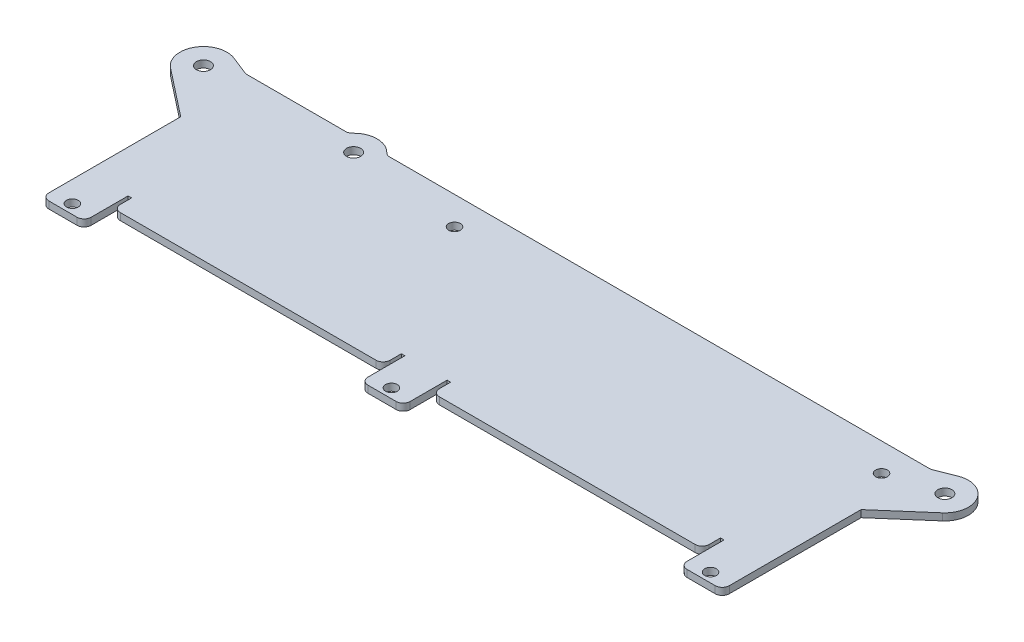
ISO-10303-21;
HEADER;
FILE_DESCRIPTION(('STEP AP214'),'2;1');
FILE_NAME('part.step','',(''),(''),'','','');
FILE_SCHEMA(('AUTOMOTIVE_DESIGN { 1 0 10303 214 1 1 1 1 }'));
ENDSEC;
DATA;
#1=APPLICATION_CONTEXT('core data for automotive mechanical design processes');
#2=APPLICATION_PROTOCOL_DEFINITION('international standard','automotive_design',2000,#1);
#3=PRODUCT_CONTEXT('',#1,'mechanical');
#4=PRODUCT('Part','Part','',(#3));
#5=PRODUCT_RELATED_PRODUCT_CATEGORY('part','',(#4));
#6=PRODUCT_DEFINITION_FORMATION('','',#4);
#7=PRODUCT_DEFINITION_CONTEXT('part definition',#1,'design');
#8=PRODUCT_DEFINITION('design','',#6,#7);
#9=PRODUCT_DEFINITION_SHAPE('','',#8);
#10=(LENGTH_UNIT() NAMED_UNIT(*) SI_UNIT(.MILLI.,.METRE.));
#11=(NAMED_UNIT(*) PLANE_ANGLE_UNIT() SI_UNIT($,.RADIAN.));
#12=(NAMED_UNIT(*) SI_UNIT($,.STERADIAN.) SOLID_ANGLE_UNIT());
#13=UNCERTAINTY_MEASURE_WITH_UNIT(LENGTH_MEASURE(1.E-05),#10,'distance_accuracy_value','');
#14=(GEOMETRIC_REPRESENTATION_CONTEXT(3) GLOBAL_UNCERTAINTY_ASSIGNED_CONTEXT((#13)) GLOBAL_UNIT_ASSIGNED_CONTEXT((#10,
#11,#12)) REPRESENTATION_CONTEXT('',''));
#15=CARTESIAN_POINT('',(0.,0.,0.));
#16=DIRECTION('',(0.,0.,1.));
#17=DIRECTION('',(1.,0.,0.));
#18=AXIS2_PLACEMENT_3D('',#15,#16,#17);
#19=CARTESIAN_POINT('',(0.,-1.5,7.96991118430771));
#20=DIRECTION('',(0.,-1.,0.));
#21=DIRECTION('',(0.,0.,-1.));
#22=AXIS2_PLACEMENT_3D('',#19,#20,#21);
#23=PLANE('',#22);
#24=DIRECTION('',(1.,0.,0.));
#25=VECTOR('',#24,1.);
#26=CARTESIAN_POINT('',(72.5,-1.50000000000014,29.9699111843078));
#27=LINE('',#26,#25);
#28=CARTESIAN_POINT('',(-61.25,-1.50000000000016,29.9699111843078));
#29=VERTEX_POINT('',#28);
#30=CARTESIAN_POINT('',(-6.75000000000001,-1.50000000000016,29.9699111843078));
#31=VERTEX_POINT('',#30);
#32=EDGE_CURVE('E852',#29,#31,#27,.T.);
#33=ORIENTED_EDGE('',*,*,#32,.F.);
#34=CARTESIAN_POINT('',(-61.25,-1.50000000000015,28.4699111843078));
#35=DIRECTION('',(0.,-1.,0.));
#36=DIRECTION('',(0.,0.,-1.));
#37=AXIS2_PLACEMENT_3D('',#34,#35,#36);
#38=CIRCLE('',#37,1.5);
#39=CARTESIAN_POINT('',(-62.75,-1.50000000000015,28.4699111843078));
#40=VERTEX_POINT('',#39);
#41=EDGE_CURVE('E882',#29,#40,#38,.T.);
#42=ORIENTED_EDGE('',*,*,#41,.T.);
#43=DIRECTION('',(0.,0.,-1.));
#44=VECTOR('',#43,1.);
#45=CARTESIAN_POINT('',(-62.75,-1.50000000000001,7.96991118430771));
#46=LINE('',#45,#44);
#47=CARTESIAN_POINT('',(-62.75,-1.50000000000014,26.0699111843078));
#48=VERTEX_POINT('',#47);
#49=EDGE_CURVE('E733',#40,#48,#46,.T.);
#50=ORIENTED_EDGE('',*,*,#49,.T.);
#51=DIRECTION('',(-1.,0.,0.));
#52=VECTOR('',#51,1.);
#53=CARTESIAN_POINT('',(0.,-1.50000000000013,26.0699111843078));
#54=LINE('',#53,#52);
#55=CARTESIAN_POINT('',(-63.5,-1.50000000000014,26.0699111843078));
#56=VERTEX_POINT('',#55);
#57=EDGE_CURVE('E753',#48,#56,#54,.T.);
#58=ORIENTED_EDGE('',*,*,#57,.T.);
#59=DIRECTION('',(0.,0.,1.));
#60=VECTOR('',#59,1.);
#61=CARTESIAN_POINT('',(-63.5,-1.50000000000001,7.96991118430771));
#62=LINE('',#61,#60);
#63=CARTESIAN_POINT('',(-63.5,-1.50000000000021,33.9398223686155));
#64=VERTEX_POINT('',#63);
#65=EDGE_CURVE('E750',#56,#64,#62,.T.);
#66=ORIENTED_EDGE('',*,*,#65,.T.);
#67=CARTESIAN_POINT('',(-65.,-1.50000000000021,33.9398223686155));
#68=DIRECTION('',(0.,-1.,0.));
#69=DIRECTION('',(0.,0.,-1.));
#70=AXIS2_PLACEMENT_3D('',#67,#68,#69);
#71=CIRCLE('',#70,1.5);
#72=CARTESIAN_POINT('',(-65.,-1.50000000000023,35.4398223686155));
#73=VERTEX_POINT('',#72);
#74=EDGE_CURVE('E709',#64,#73,#71,.T.);
#75=ORIENTED_EDGE('',*,*,#74,.T.);
#76=DIRECTION('',(1.,0.,0.));
#77=VECTOR('',#76,1.);
#78=CARTESIAN_POINT('',(-136.,-1.50000000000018,35.4398223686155));
#79=LINE('',#78,#77);
#80=CARTESIAN_POINT('',(-71.,-1.50000000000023,35.4398223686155));
#81=VERTEX_POINT('',#80);
#82=EDGE_CURVE('E705',#73,#81,#79,.F.);
#83=ORIENTED_EDGE('',*,*,#82,.T.);
#84=CARTESIAN_POINT('',(-71.,-1.50000000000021,33.9398223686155));
#85=DIRECTION('',(0.,-1.,0.));
#86=DIRECTION('',(0.,0.,-1.));
#87=AXIS2_PLACEMENT_3D('',#84,#85,#86);
#88=CIRCLE('',#87,1.5);
#89=CARTESIAN_POINT('',(-72.5,-1.50000000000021,33.9398223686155));
#90=VERTEX_POINT('',#89);
#91=EDGE_CURVE('E701',#81,#90,#88,.T.);
#92=ORIENTED_EDGE('',*,*,#91,.T.);
#93=DIRECTION('',(0.,0.,1.));
#94=VECTOR('',#93,1.);
#95=CARTESIAN_POINT('',(-72.5,-1.50000000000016,29.9699111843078));
#96=LINE('',#95,#94);
#97=CARTESIAN_POINT('',(-72.5,-1.50000000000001,5.84999999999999));
#98=VERTEX_POINT('',#97);
#99=EDGE_CURVE('E856',#98,#90,#96,.T.);
#100=ORIENTED_EDGE('',*,*,#99,.F.);
#101=DIRECTION('',(0.786649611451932,0.,0.617399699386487));
#102=VECTOR('',#101,1.);
#103=CARTESIAN_POINT('',(-82.5869984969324,-1.5,-2.06675194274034));
#104=LINE('',#103,#102);
#105=CARTESIAN_POINT('',(-82.5869984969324,-1.5,-2.06675194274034));
#106=VERTEX_POINT('',#105);
#107=EDGE_CURVE('E478',#106,#98,#104,.T.);
#108=ORIENTED_EDGE('',*,*,#107,.F.);
#109=CARTESIAN_POINT('',(-79.5,-1.5,-5.99999999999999));
#110=DIRECTION('',(0.,1.,0.));
#111=DIRECTION('',(0.,0.,1.));
#112=AXIS2_PLACEMENT_3D('',#109,#110,#111);
#113=CIRCLE('',#112,4.99999999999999);
#114=CARTESIAN_POINT('',(-77.6573786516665,-1.5,-10.6480906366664));
#115=VERTEX_POINT('',#114);
#116=EDGE_CURVE('E570',#115,#106,#113,.T.);
#117=ORIENTED_EDGE('',*,*,#116,.F.);
#118=DIRECTION('',(-0.929618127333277,0.,-0.368524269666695));
#119=VECTOR('',#118,1.);
#120=CARTESIAN_POINT('',(-73.5,-1.5,-8.99999999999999));
#121=LINE('',#120,#119);
#122=CARTESIAN_POINT('',(-73.7663118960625,-1.5,-9.10557280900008));
#123=VERTEX_POINT('',#122);
#124=EDGE_CURVE('E578',#123,#115,#121,.T.);
#125=ORIENTED_EDGE('',*,*,#124,.F.);
#126=CARTESIAN_POINT('',(-73.2135254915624,-1.5,-10.5));
#127=DIRECTION('',(0.,1.,0.));
#128=DIRECTION('',(0.,0.,1.));
#129=AXIS2_PLACEMENT_3D('',#126,#127,#128);
#130=CIRCLE('',#129,1.5);
#131=CARTESIAN_POINT('',(-73.2135254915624,-1.5,-8.99999999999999));
#132=VERTEX_POINT('',#131);
#133=EDGE_CURVE('E486',#123,#132,#130,.T.);
#134=ORIENTED_EDGE('',*,*,#133,.T.);
#135=DIRECTION('',(-1.,0.,0.));
#136=VECTOR('',#135,1.);
#137=CARTESIAN_POINT('',(72.5,-1.5,-9.00000000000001));
#138=LINE('',#137,#136);
#139=CARTESIAN_POINT('',(-52.1904157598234,-1.5,-9.));
#140=VERTEX_POINT('',#139);
#141=EDGE_CURVE('E534',#140,#132,#138,.T.);
#142=ORIENTED_EDGE('',*,*,#141,.F.);
#143=CARTESIAN_POINT('',(-52.1904157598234,-1.5,-10.5));
#144=DIRECTION('',(0.,1.,0.));
#145=DIRECTION('',(0.,0.,1.));
#146=AXIS2_PLACEMENT_3D('',#143,#144,#145);
#147=CIRCLE('',#146,1.5);
#148=CARTESIAN_POINT('',(-51.1080121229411,-1.5,-9.46153846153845));
#149=VERTEX_POINT('',#148);
#150=EDGE_CURVE('E503',#140,#149,#147,.T.);
#151=ORIENTED_EDGE('',*,*,#150,.T.);
#152=CARTESIAN_POINT('',(-47.5,-1.5,-5.99999999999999));
#153=DIRECTION('',(0.,1.,0.));
#154=DIRECTION('',(0.,0.,1.));
#155=AXIS2_PLACEMENT_3D('',#152,#153,#154);
#156=CIRCLE('',#155,4.99999999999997);
#157=CARTESIAN_POINT('',(-43.8919878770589,-1.5,-9.46153846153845));
#158=VERTEX_POINT('',#157);
#159=EDGE_CURVE('E546',#158,#149,#156,.T.);
#160=ORIENTED_EDGE('',*,*,#159,.F.);
#161=CARTESIAN_POINT('',(-42.8095842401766,-1.5,-10.5));
#162=DIRECTION('',(0.,1.,0.));
#163=DIRECTION('',(0.,0.,1.));
#164=AXIS2_PLACEMENT_3D('',#161,#162,#163);
#165=CIRCLE('',#164,1.5);
#166=CARTESIAN_POINT('',(-42.8095842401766,-1.5,-9.));
#167=VERTEX_POINT('',#166);
#168=EDGE_CURVE('E500',#158,#167,#165,.T.);
#169=ORIENTED_EDGE('',*,*,#168,.T.);
#170=CARTESIAN_POINT('',(72.2135254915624,-1.5,-9.00000000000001));
#171=VERTEX_POINT('',#170);
#172=EDGE_CURVE('E539',#171,#167,#138,.T.);
#173=ORIENTED_EDGE('',*,*,#172,.F.);
#174=CARTESIAN_POINT('',(72.2135254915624,-1.5,-10.5));
#175=DIRECTION('',(0.,1.,0.));
#176=DIRECTION('',(0.,0.,1.));
#177=AXIS2_PLACEMENT_3D('',#174,#175,#176);
#178=CIRCLE('',#177,1.5);
#179=CARTESIAN_POINT('',(72.7663118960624,-1.5,-9.10557280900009));
#180=VERTEX_POINT('',#179);
#181=EDGE_CURVE('E497',#171,#180,#178,.T.);
#182=ORIENTED_EDGE('',*,*,#181,.T.);
#183=DIRECTION('',(0.929618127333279,0.,-0.368524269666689));
#184=VECTOR('',#183,1.);
#185=CARTESIAN_POINT('',(72.5,-1.5,-9.00000000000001));
#186=LINE('',#185,#184);
#187=CARTESIAN_POINT('',(76.6573786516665,-1.5,-10.6480906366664));
#188=VERTEX_POINT('',#187);
#189=EDGE_CURVE('E494',#180,#188,#186,.T.);
#190=ORIENTED_EDGE('',*,*,#189,.T.);
#191=CARTESIAN_POINT('',(78.5,-1.5,-5.99999999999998));
#192=DIRECTION('',(0.,-1.,0.));
#193=DIRECTION('',(0.,0.,1.));
#194=AXIS2_PLACEMENT_3D('',#191,#192,#193);
#195=CIRCLE('',#194,5.);
#196=CARTESIAN_POINT('',(81.7824274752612,-1.5,-2.22830676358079));
#197=VERTEX_POINT('',#196);
#198=EDGE_CURVE('E491',#188,#197,#195,.T.);
#199=ORIENTED_EDGE('',*,*,#198,.T.);
#200=DIRECTION('',(-0.754338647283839,0.,0.656485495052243));
#201=VECTOR('',#200,1.);
#202=CARTESIAN_POINT('',(72.5,-1.5,5.84999999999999));
#203=LINE('',#202,#201);
#204=CARTESIAN_POINT('',(72.5,-1.5,5.84999999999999));
#205=VERTEX_POINT('',#204);
#206=EDGE_CURVE('E414',#197,#205,#203,.T.);
#207=ORIENTED_EDGE('',*,*,#206,.T.);
#208=DIRECTION('',(0.,0.,-1.));
#209=VECTOR('',#208,1.);
#210=CARTESIAN_POINT('',(72.5,-1.49999999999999,7.96991118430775));
#211=LINE('',#210,#209);
#212=CARTESIAN_POINT('',(72.5,-1.50000000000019,33.9398223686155));
#213=VERTEX_POINT('',#212);
#214=EDGE_CURVE('E848',#213,#205,#211,.T.);
#215=ORIENTED_EDGE('',*,*,#214,.F.);
#216=CARTESIAN_POINT('',(71.,-1.50000000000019,33.9398223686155));
#217=DIRECTION('',(0.,-1.,0.));
#218=DIRECTION('',(0.,0.,-1.));
#219=AXIS2_PLACEMENT_3D('',#216,#217,#218);
#220=CIRCLE('',#219,1.5);
#221=CARTESIAN_POINT('',(71.,-1.50000000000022,35.4398223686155));
#222=VERTEX_POINT('',#221);
#223=EDGE_CURVE('E619',#213,#222,#220,.T.);
#224=ORIENTED_EDGE('',*,*,#223,.T.);
#225=DIRECTION('',(1.,0.,0.));
#226=VECTOR('',#225,1.);
#227=CARTESIAN_POINT('',(0.,-1.50000000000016,35.4398223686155));
#228=LINE('',#227,#226);
#229=CARTESIAN_POINT('',(65.,-1.50000000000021,35.4398223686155));
#230=VERTEX_POINT('',#229);
#231=EDGE_CURVE('E615',#222,#230,#228,.F.);
#232=ORIENTED_EDGE('',*,*,#231,.T.);
#233=CARTESIAN_POINT('',(65.,-1.50000000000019,33.9398223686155));
#234=DIRECTION('',(0.,-1.,0.));
#235=DIRECTION('',(0.,0.,-1.));
#236=AXIS2_PLACEMENT_3D('',#233,#234,#235);
#237=CIRCLE('',#236,1.5);
#238=CARTESIAN_POINT('',(63.5,-1.50000000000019,33.9398223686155));
#239=VERTEX_POINT('',#238);
#240=EDGE_CURVE('E611',#230,#239,#237,.T.);
#241=ORIENTED_EDGE('',*,*,#240,.T.);
#242=DIRECTION('',(0.,0.,-1.));
#243=VECTOR('',#242,1.);
#244=CARTESIAN_POINT('',(63.5,-1.49999999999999,7.96991118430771));
#245=LINE('',#244,#243);
#246=CARTESIAN_POINT('',(63.5,-1.50000000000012,26.0699111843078));
#247=VERTEX_POINT('',#246);
#248=EDGE_CURVE('E843',#239,#247,#245,.T.);
#249=ORIENTED_EDGE('',*,*,#248,.T.);
#250=DIRECTION('',(-1.,0.,0.));
#251=VECTOR('',#250,1.);
#252=CARTESIAN_POINT('',(0.,-1.50000000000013,26.0699111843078));
#253=LINE('',#252,#251);
#254=CARTESIAN_POINT('',(62.75,-1.50000000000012,26.0699111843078));
#255=VERTEX_POINT('',#254);
#256=EDGE_CURVE('E839',#247,#255,#253,.T.);
#257=ORIENTED_EDGE('',*,*,#256,.T.);
#258=DIRECTION('',(0.,0.,1.));
#259=VECTOR('',#258,1.);
#260=CARTESIAN_POINT('',(62.75,-1.49999999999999,7.96991118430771));
#261=LINE('',#260,#259);
#262=CARTESIAN_POINT('',(62.75,-1.50000000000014,28.4699111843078));
#263=VERTEX_POINT('',#262);
#264=EDGE_CURVE('E821',#255,#263,#261,.T.);
#265=ORIENTED_EDGE('',*,*,#264,.T.);
#266=CARTESIAN_POINT('',(61.25,-1.50000000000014,28.4699111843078));
#267=DIRECTION('',(0.,-1.,0.));
#268=DIRECTION('',(0.,0.,-1.));
#269=AXIS2_PLACEMENT_3D('',#266,#267,#268);
#270=CIRCLE('',#269,1.5);
#271=CARTESIAN_POINT('',(61.25,-1.50000000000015,29.9699111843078));
#272=VERTEX_POINT('',#271);
#273=EDGE_CURVE('E873',#263,#272,#270,.T.);
#274=ORIENTED_EDGE('',*,*,#273,.T.);
#275=CARTESIAN_POINT('',(6.74999999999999,-1.50000000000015,29.9699111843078));
#276=VERTEX_POINT('',#275);
#277=EDGE_CURVE('E853',#276,#272,#27,.T.);
#278=ORIENTED_EDGE('',*,*,#277,.F.);
#279=CARTESIAN_POINT('',(6.74999999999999,-1.50000000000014,28.4699111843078));
#280=DIRECTION('',(0.,-1.,0.));
#281=DIRECTION('',(0.,0.,-1.));
#282=AXIS2_PLACEMENT_3D('',#279,#280,#281);
#283=CIRCLE('',#282,1.5);
#284=CARTESIAN_POINT('',(5.24999999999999,-1.50000000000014,28.4699111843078));
#285=VERTEX_POINT('',#284);
#286=EDGE_CURVE('E879',#276,#285,#283,.T.);
#287=ORIENTED_EDGE('',*,*,#286,.T.);
#288=DIRECTION('',(0.,0.,-1.));
#289=VECTOR('',#288,1.);
#290=CARTESIAN_POINT('',(5.24999999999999,-1.5,7.96991118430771));
#291=LINE('',#290,#289);
#292=CARTESIAN_POINT('',(5.24999999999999,-1.50000000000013,26.0699111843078));
#293=VERTEX_POINT('',#292);
#294=EDGE_CURVE('E798',#285,#293,#291,.T.);
#295=ORIENTED_EDGE('',*,*,#294,.T.);
#296=DIRECTION('',(-1.,0.,0.));
#297=VECTOR('',#296,1.);
#298=CARTESIAN_POINT('',(0.,-1.50000000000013,26.0699111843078));
#299=LINE('',#298,#297);
#300=CARTESIAN_POINT('',(4.49999999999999,-1.50000000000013,26.0699111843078));
#301=VERTEX_POINT('',#300);
#302=EDGE_CURVE('E812',#293,#301,#299,.T.);
#303=ORIENTED_EDGE('',*,*,#302,.T.);
#304=DIRECTION('',(0.,0.,1.));
#305=VECTOR('',#304,1.);
#306=CARTESIAN_POINT('',(4.49999999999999,-1.5,7.96991118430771));
#307=LINE('',#306,#305);
#308=CARTESIAN_POINT('',(4.49999999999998,-1.5000000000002,33.9398223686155));
#309=VERTEX_POINT('',#308);
#310=EDGE_CURVE('E809',#301,#309,#307,.T.);
#311=ORIENTED_EDGE('',*,*,#310,.T.);
#312=CARTESIAN_POINT('',(2.99999999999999,-1.5000000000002,33.9398223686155));
#313=DIRECTION('',(0.,-1.,0.));
#314=DIRECTION('',(0.,0.,-1.));
#315=AXIS2_PLACEMENT_3D('',#312,#313,#314);
#316=CIRCLE('',#315,1.5);
#317=CARTESIAN_POINT('',(2.99999999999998,-1.50000000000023,35.4398223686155));
#318=VERTEX_POINT('',#317);
#319=EDGE_CURVE('E664',#309,#318,#316,.T.);
#320=ORIENTED_EDGE('',*,*,#319,.T.);
#321=DIRECTION('',(1.,0.,0.));
#322=VECTOR('',#321,1.);
#323=CARTESIAN_POINT('',(-68.,-1.50000000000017,35.4398223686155));
#324=LINE('',#323,#322);
#325=CARTESIAN_POINT('',(-3.00000000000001,-1.50000000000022,35.4398223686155));
#326=VERTEX_POINT('',#325);
#327=EDGE_CURVE('E660',#318,#326,#324,.F.);
#328=ORIENTED_EDGE('',*,*,#327,.T.);
#329=CARTESIAN_POINT('',(-3.00000000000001,-1.5000000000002,33.9398223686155));
#330=DIRECTION('',(0.,-1.,0.));
#331=DIRECTION('',(0.,0.,-1.));
#332=AXIS2_PLACEMENT_3D('',#329,#330,#331);
#333=CIRCLE('',#332,1.5);
#334=CARTESIAN_POINT('',(-4.50000000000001,-1.5000000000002,33.9398223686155));
#335=VERTEX_POINT('',#334);
#336=EDGE_CURVE('E656',#326,#335,#333,.T.);
#337=ORIENTED_EDGE('',*,*,#336,.T.);
#338=DIRECTION('',(0.,0.,-1.));
#339=VECTOR('',#338,1.);
#340=CARTESIAN_POINT('',(-4.5,-1.5,7.96991118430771));
#341=LINE('',#340,#339);
#342=CARTESIAN_POINT('',(-4.5,-1.50000000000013,26.0699111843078));
#343=VERTEX_POINT('',#342);
#344=EDGE_CURVE('E805',#335,#343,#341,.T.);
#345=ORIENTED_EDGE('',*,*,#344,.T.);
#346=DIRECTION('',(-1.,0.,0.));
#347=VECTOR('',#346,1.);
#348=CARTESIAN_POINT('',(0.,-1.50000000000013,26.0699111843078));
#349=LINE('',#348,#347);
#350=CARTESIAN_POINT('',(-5.25,-1.50000000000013,26.0699111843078));
#351=VERTEX_POINT('',#350);
#352=EDGE_CURVE('E801',#343,#351,#349,.T.);
#353=ORIENTED_EDGE('',*,*,#352,.T.);
#354=DIRECTION('',(0.,0.,1.));
#355=VECTOR('',#354,1.);
#356=CARTESIAN_POINT('',(-5.25,-1.5,7.96991118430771));
#357=LINE('',#356,#355);
#358=CARTESIAN_POINT('',(-5.25,-1.50000000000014,28.4699111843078));
#359=VERTEX_POINT('',#358);
#360=EDGE_CURVE('E760',#351,#359,#357,.T.);
#361=ORIENTED_EDGE('',*,*,#360,.T.);
#362=CARTESIAN_POINT('',(-6.75,-1.50000000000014,28.4699111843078));
#363=DIRECTION('',(0.,-1.,0.));
#364=DIRECTION('',(0.,0.,-1.));
#365=AXIS2_PLACEMENT_3D('',#362,#363,#364);
#366=CIRCLE('',#365,1.5);
#367=EDGE_CURVE('E876',#359,#31,#366,.T.);
#368=ORIENTED_EDGE('',*,*,#367,.T.);
#369=EDGE_LOOP('',(#33,#42,#50,#58,#66,#75,#83,#92,#100,#108,#117,#125,#134,#142,#151,#160,#169,
#173,#182,#190,#199,#207,#215,#224,#232,#241,#249,#257,#265,#274,#278,#287,#295,#303,#311,#320,
#328,#337,#345,#353,#361,#368));
#370=FACE_BOUND('',#369,.T.);
#371=CARTESIAN_POINT('',(-68.,-1.50000000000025,33.4398223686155));
#372=DIRECTION('',(0.,-1.,0.));
#373=DIRECTION('',(0.,0.,-1.));
#374=AXIS2_PLACEMENT_3D('',#371,#372,#373);
#375=CIRCLE('',#374,1.25);
#376=CARTESIAN_POINT('',(-68.,-1.50000000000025,32.1898223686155));
#377=VERTEX_POINT('',#376);
#378=EDGE_CURVE('E712',#377,#377,#375,.T.);
#379=ORIENTED_EDGE('',*,*,#378,.F.);
#380=EDGE_LOOP('',(#379));
#381=FACE_BOUND('',#380,.T.);
#382=CARTESIAN_POINT('',(0.,-1.50000000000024,33.4398223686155));
#383=DIRECTION('',(0.,-1.,0.));
#384=DIRECTION('',(0.,0.,-1.));
#385=AXIS2_PLACEMENT_3D('',#382,#383,#384);
#386=CIRCLE('',#385,1.25);
#387=CARTESIAN_POINT('',(0.,-1.50000000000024,32.1898223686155));
#388=VERTEX_POINT('',#387);
#389=EDGE_CURVE('E667',#388,#388,#386,.T.);
#390=ORIENTED_EDGE('',*,*,#389,.F.);
#391=EDGE_LOOP('',(#390));
#392=FACE_BOUND('',#391,.T.);
#393=CARTESIAN_POINT('',(68.,-1.50000000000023,33.4398223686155));
#394=DIRECTION('',(0.,-1.,0.));
#395=DIRECTION('',(0.,0.,-1.));
#396=AXIS2_PLACEMENT_3D('',#393,#394,#395);
#397=CIRCLE('',#396,1.25);
#398=CARTESIAN_POINT('',(68.,-1.50000000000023,32.1898223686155));
#399=VERTEX_POINT('',#398);
#400=EDGE_CURVE('E622',#399,#399,#397,.T.);
#401=ORIENTED_EDGE('',*,*,#400,.F.);
#402=EDGE_LOOP('',(#401));
#403=FACE_BOUND('',#402,.T.);
#404=CARTESIAN_POINT('',(68.,-1.5,-3.00000000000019));
#405=DIRECTION('',(0.,1.,0.));
#406=DIRECTION('',(0.,0.,1.));
#407=AXIS2_PLACEMENT_3D('',#404,#405,#406);
#408=CIRCLE('',#407,1.25000000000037);
#409=CARTESIAN_POINT('',(68.,-1.5,-1.74999999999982));
#410=VERTEX_POINT('',#409);
#411=EDGE_CURVE('E510',#410,#410,#408,.F.);
#412=ORIENTED_EDGE('',*,*,#411,.F.);
#413=EDGE_LOOP('',(#412));
#414=FACE_BOUND('',#413,.T.);
#415=CARTESIAN_POINT('',(-23.,-1.5,-3.00000000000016));
#416=DIRECTION('',(0.,1.,0.));
#417=DIRECTION('',(0.,0.,1.));
#418=AXIS2_PLACEMENT_3D('',#415,#416,#417);
#419=CIRCLE('',#418,1.25);
#420=CARTESIAN_POINT('',(-23.,-1.5,-1.75000000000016));
#421=VERTEX_POINT('',#420);
#422=EDGE_CURVE('E518',#421,#421,#419,.F.);
#423=ORIENTED_EDGE('',*,*,#422,.F.);
#424=EDGE_LOOP('',(#423));
#425=FACE_BOUND('',#424,.T.);
#426=CARTESIAN_POINT('',(-47.5,-1.50000000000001,-5.99999999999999));
#427=DIRECTION('',(0.,1.,0.));
#428=DIRECTION('',(0.,0.,1.));
#429=AXIS2_PLACEMENT_3D('',#426,#427,#428);
#430=CIRCLE('',#429,1.5);
#431=CARTESIAN_POINT('',(-47.5,-1.50000000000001,-4.5));
#432=VERTEX_POINT('',#431);
#433=EDGE_CURVE('E506',#432,#432,#430,.T.);
#434=ORIENTED_EDGE('',*,*,#433,.T.);
#435=EDGE_LOOP('',(#434));
#436=FACE_BOUND('',#435,.T.);
#437=CARTESIAN_POINT('',(-79.5,-1.5,-5.99999999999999));
#438=DIRECTION('',(0.,1.,0.));
#439=DIRECTION('',(0.,0.,1.));
#440=AXIS2_PLACEMENT_3D('',#437,#438,#439);
#441=CIRCLE('',#440,1.49999999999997);
#442=CARTESIAN_POINT('',(-79.5,-1.5,-4.50000000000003));
#443=VERTEX_POINT('',#442);
#444=EDGE_CURVE('E482',#443,#443,#441,.T.);
#445=ORIENTED_EDGE('',*,*,#444,.T.);
#446=EDGE_LOOP('',(#445));
#447=FACE_BOUND('',#446,.T.);
#448=CARTESIAN_POINT('',(78.5,-1.5,-5.99999999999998));
#449=DIRECTION('',(0.,-1.,0.));
#450=DIRECTION('',(0.,0.,-1.));
#451=AXIS2_PLACEMENT_3D('',#448,#449,#450);
#452=CIRCLE('',#451,1.5);
#453=CARTESIAN_POINT('',(78.5,-1.5,-7.49999999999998));
#454=VERTEX_POINT('',#453);
#455=EDGE_CURVE('E588',#454,#454,#452,.T.);
#456=ORIENTED_EDGE('',*,*,#455,.F.);
#457=EDGE_LOOP('',(#456));
#458=FACE_BOUND('',#457,.T.);
#459=ADVANCED_FACE('F133',(#370,#381,#392,#403,#414,#425,#436,#447,#458),#23,.T.);
#460=CARTESIAN_POINT('',(0.,0.,0.));
#461=DIRECTION('',(0.,1.,0.));
#462=DIRECTION('',(0.,0.,1.));
#463=AXIS2_PLACEMENT_3D('',#460,#461,#462);
#464=PLANE('',#463);
#465=DIRECTION('',(0.,0.,-1.));
#466=VECTOR('',#465,1.);
#467=CARTESIAN_POINT('',(-62.75,-1.6306400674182E-13,29.9699111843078));
#468=LINE('',#467,#466);
#469=CARTESIAN_POINT('',(-62.75,-1.51788304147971E-13,28.4699111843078));
#470=VERTEX_POINT('',#469);
#471=CARTESIAN_POINT('',(-62.75,-1.36175792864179E-13,26.0699111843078));
#472=VERTEX_POINT('',#471);
#473=EDGE_CURVE('E730',#470,#472,#468,.T.);
#474=ORIENTED_EDGE('',*,*,#473,.F.);
#475=CARTESIAN_POINT('',(-61.25,-1.53523027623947E-13,28.4699111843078));
#476=DIRECTION('',(0.,-1.,0.));
#477=DIRECTION('',(0.,0.,-1.));
#478=AXIS2_PLACEMENT_3D('',#475,#476,#477);
#479=CIRCLE('',#478,1.5);
#480=CARTESIAN_POINT('',(-61.25,-1.63931368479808E-13,29.9699111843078));
#481=VERTEX_POINT('',#480);
#482=EDGE_CURVE('E896',#470,#481,#479,.F.);
#483=ORIENTED_EDGE('',*,*,#482,.T.);
#484=DIRECTION('',(-1.,0.,0.));
#485=VECTOR('',#484,1.);
#486=CARTESIAN_POINT('',(0.,-1.55257751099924E-13,29.9699111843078));
#487=LINE('',#486,#485);
#488=CARTESIAN_POINT('',(-6.75,-1.56125112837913E-13,29.9699111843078));
#489=VERTEX_POINT('',#488);
#490=EDGE_CURVE('E861',#481,#489,#487,.F.);
#491=ORIENTED_EDGE('',*,*,#490,.T.);
#492=CARTESIAN_POINT('',(-6.75,-1.45716771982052E-13,28.4699111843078));
#493=DIRECTION('',(0.,-1.,0.));
#494=DIRECTION('',(0.,0.,-1.));
#495=AXIS2_PLACEMENT_3D('',#492,#493,#494);
#496=CIRCLE('',#495,1.5);
#497=CARTESIAN_POINT('',(-5.25,-1.37910516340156E-13,28.4699111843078));
#498=VERTEX_POINT('',#497);
#499=EDGE_CURVE('E890',#489,#498,#496,.F.);
#500=ORIENTED_EDGE('',*,*,#499,.T.);
#501=DIRECTION('',(0.,0.,1.));
#502=VECTOR('',#501,1.);
#503=CARTESIAN_POINT('',(-5.25,-1.17093834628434E-13,26.0699111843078));
#504=LINE('',#503,#502);
#505=CARTESIAN_POINT('',(-5.25,-1.17093834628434E-13,26.0699111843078));
#506=VERTEX_POINT('',#505);
#507=EDGE_CURVE('E779',#506,#498,#504,.T.);
#508=ORIENTED_EDGE('',*,*,#507,.F.);
#509=DIRECTION('',(-1.,0.,0.));
#510=VECTOR('',#509,1.);
#511=CARTESIAN_POINT('',(-4.5,-1.17093834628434E-13,26.0699111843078));
#512=LINE('',#511,#510);
#513=CARTESIAN_POINT('',(-4.5,-1.17093834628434E-13,26.0699111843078));
#514=VERTEX_POINT('',#513);
#515=EDGE_CURVE('E774',#514,#506,#512,.T.);
#516=ORIENTED_EDGE('',*,*,#515,.F.);
#517=DIRECTION('',(0.,0.,-1.));
#518=VECTOR('',#517,1.);
#519=CARTESIAN_POINT('',(-4.5,-1.22298005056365E-13,26.8199111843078));
#520=LINE('',#519,#518);
#521=CARTESIAN_POINT('',(-4.50000000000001,-1.95156391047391E-13,33.9398223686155));
#522=VERTEX_POINT('',#521);
#523=EDGE_CURVE('E770',#522,#514,#520,.T.);
#524=ORIENTED_EDGE('',*,*,#523,.F.);
#525=CARTESIAN_POINT('',(-3.00000000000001,-1.95156391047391E-13,33.9398223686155));
#526=DIRECTION('',(0.,-1.,0.));
#527=DIRECTION('',(0.,0.,-1.));
#528=AXIS2_PLACEMENT_3D('',#525,#526,#527);
#529=CIRCLE('',#528,1.5);
#530=CARTESIAN_POINT('',(-3.00000000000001,-2.17707796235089E-13,35.4398223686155));
#531=VERTEX_POINT('',#530);
#532=EDGE_CURVE('E645',#522,#531,#529,.F.);
#533=ORIENTED_EDGE('',*,*,#532,.T.);
#534=DIRECTION('',(-1.,0.,0.));
#535=VECTOR('',#534,1.);
#536=CARTESIAN_POINT('',(4.49999999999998,-2.24646690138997E-13,35.4398223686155));
#537=LINE('',#536,#535);
#538=CARTESIAN_POINT('',(2.99999999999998,-2.24646690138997E-13,35.4398223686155));
#539=VERTEX_POINT('',#538);
#540=EDGE_CURVE('E678',#539,#531,#537,.T.);
#541=ORIENTED_EDGE('',*,*,#540,.F.);
#542=CARTESIAN_POINT('',(2.99999999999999,-2.02095284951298E-13,33.9398223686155));
#543=DIRECTION('',(0.,-1.,0.));
#544=DIRECTION('',(0.,0.,-1.));
#545=AXIS2_PLACEMENT_3D('',#542,#543,#544);
#546=CIRCLE('',#545,1.5);
#547=CARTESIAN_POINT('',(4.49999999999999,-2.02095284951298E-13,33.9398223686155));
#548=VERTEX_POINT('',#547);
#549=EDGE_CURVE('E648',#539,#548,#546,.F.);
#550=ORIENTED_EDGE('',*,*,#549,.T.);
#551=DIRECTION('',(0.,0.,1.));
#552=VECTOR('',#551,1.);
#553=CARTESIAN_POINT('',(4.49999999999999,-1.24032728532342E-13,26.0699111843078));
#554=LINE('',#553,#552);
#555=CARTESIAN_POINT('',(4.49999999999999,-1.24032728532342E-13,26.0699111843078));
#556=VERTEX_POINT('',#555);
#557=EDGE_CURVE('E766',#556,#548,#554,.T.);
#558=ORIENTED_EDGE('',*,*,#557,.F.);
#559=DIRECTION('',(-1.,0.,0.));
#560=VECTOR('',#559,1.);
#561=CARTESIAN_POINT('',(5.24999999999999,-1.24032728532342E-13,26.0699111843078));
#562=LINE('',#561,#560);
#563=CARTESIAN_POINT('',(5.24999999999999,-1.24032728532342E-13,26.0699111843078));
#564=VERTEX_POINT('',#563);
#565=EDGE_CURVE('E761',#564,#556,#562,.T.);
#566=ORIENTED_EDGE('',*,*,#565,.F.);
#567=DIRECTION('',(0.,0.,-1.));
#568=VECTOR('',#567,1.);
#569=CARTESIAN_POINT('',(5.24999999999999,-1.53523027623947E-13,29.9699111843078));
#570=LINE('',#569,#568);
#571=CARTESIAN_POINT('',(5.24999999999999,-1.42247325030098E-13,28.4699111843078));
#572=VERTEX_POINT('',#571);
#573=EDGE_CURVE('E757',#572,#564,#570,.T.);
#574=ORIENTED_EDGE('',*,*,#573,.F.);
#575=CARTESIAN_POINT('',(6.74999999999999,-1.43982048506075E-13,28.4699111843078));
#576=DIRECTION('',(0.,-1.,0.));
#577=DIRECTION('',(0.,0.,-1.));
#578=AXIS2_PLACEMENT_3D('',#575,#576,#577);
#579=CIRCLE('',#578,1.5);
#580=CARTESIAN_POINT('',(6.74999999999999,-1.54390389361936E-13,29.9699111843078));
#581=VERTEX_POINT('',#580);
#582=EDGE_CURVE('E893',#572,#581,#579,.F.);
#583=ORIENTED_EDGE('',*,*,#582,.T.);
#584=CARTESIAN_POINT('',(61.25,-1.4658413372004E-13,29.9699111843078));
#585=VERTEX_POINT('',#584);
#586=EDGE_CURVE('E862',#581,#585,#487,.F.);
#587=ORIENTED_EDGE('',*,*,#586,.T.);
#588=CARTESIAN_POINT('',(61.25,-1.36175792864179E-13,28.4699111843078));
#589=DIRECTION('',(0.,-1.,0.));
#590=DIRECTION('',(0.,0.,-1.));
#591=AXIS2_PLACEMENT_3D('',#588,#589,#590);
#592=CIRCLE('',#591,1.5);
#593=CARTESIAN_POINT('',(62.75,-1.29236898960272E-13,28.4699111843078));
#594=VERTEX_POINT('',#593);
#595=EDGE_CURVE('E149',#585,#594,#592,.F.);
#596=ORIENTED_EDGE('',*,*,#595,.T.);
#597=DIRECTION('',(0.,0.,1.));
#598=VECTOR('',#597,1.);
#599=CARTESIAN_POINT('',(62.75,-1.0842021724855E-13,26.0699111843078));
#600=LINE('',#599,#598);
#601=CARTESIAN_POINT('',(62.75,-1.0842021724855E-13,26.0699111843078));
#602=VERTEX_POINT('',#601);
#603=EDGE_CURVE('E827',#602,#594,#600,.T.);
#604=ORIENTED_EDGE('',*,*,#603,.F.);
#605=DIRECTION('',(-1.,0.,0.));
#606=VECTOR('',#605,1.);
#607=CARTESIAN_POINT('',(63.5,-1.0842021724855E-13,26.0699111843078));
#608=LINE('',#607,#606);
#609=CARTESIAN_POINT('',(63.5,-1.0842021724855E-13,26.0699111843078));
#610=VERTEX_POINT('',#609);
#611=EDGE_CURVE('E822',#610,#602,#608,.T.);
#612=ORIENTED_EDGE('',*,*,#611,.F.);
#613=DIRECTION('',(0.,0.,-1.));
#614=VECTOR('',#613,1.);
#615=CARTESIAN_POINT('',(63.5,-1.13624387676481E-13,26.8199111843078));
#616=LINE('',#615,#614);
#617=CARTESIAN_POINT('',(63.5,-1.86482773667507E-13,33.9398223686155));
#618=VERTEX_POINT('',#617);
#619=EDGE_CURVE('E817',#618,#610,#616,.T.);
#620=ORIENTED_EDGE('',*,*,#619,.F.);
#621=CARTESIAN_POINT('',(65.,-1.8995222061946E-13,33.9398223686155));
#622=DIRECTION('',(0.,-1.,0.));
#623=DIRECTION('',(0.,0.,-1.));
#624=AXIS2_PLACEMENT_3D('',#621,#622,#623);
#625=CIRCLE('',#624,1.5);
#626=CARTESIAN_POINT('',(65.,-2.12503625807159E-13,35.4398223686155));
#627=VERTEX_POINT('',#626);
#628=EDGE_CURVE('E601',#618,#627,#625,.F.);
#629=ORIENTED_EDGE('',*,*,#628,.T.);
#630=DIRECTION('',(-1.,0.,0.));
#631=VECTOR('',#630,1.);
#632=CARTESIAN_POINT('',(72.5,-2.15973072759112E-13,35.4398223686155));
#633=LINE('',#632,#631);
#634=CARTESIAN_POINT('',(71.,-2.15973072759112E-13,35.4398223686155));
#635=VERTEX_POINT('',#634);
#636=EDGE_CURVE('E633',#635,#627,#633,.T.);
#637=ORIENTED_EDGE('',*,*,#636,.F.);
#638=CARTESIAN_POINT('',(71.,-1.93421667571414E-13,33.9398223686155));
#639=DIRECTION('',(0.,-1.,0.));
#640=DIRECTION('',(0.,0.,-1.));
#641=AXIS2_PLACEMENT_3D('',#638,#639,#640);
#642=CIRCLE('',#641,1.5);
#643=CARTESIAN_POINT('',(72.5,-1.93421667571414E-13,33.9398223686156));
#644=VERTEX_POINT('',#643);
#645=EDGE_CURVE('E604',#635,#644,#642,.F.);
#646=ORIENTED_EDGE('',*,*,#645,.T.);
#647=DIRECTION('',(0.,0.,1.));
#648=VECTOR('',#647,1.);
#649=CARTESIAN_POINT('',(72.5,0.,7.96991118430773));
#650=LINE('',#649,#648);
#651=CARTESIAN_POINT('',(72.5,0.,5.85));
#652=VERTEX_POINT('',#651);
#653=EDGE_CURVE('E434',#644,#652,#650,.F.);
#654=ORIENTED_EDGE('',*,*,#653,.T.);
#655=DIRECTION('',(-0.754338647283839,0.,0.656485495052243));
#656=VECTOR('',#655,1.);
#657=CARTESIAN_POINT('',(72.5,0.,5.84999999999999));
#658=LINE('',#657,#656);
#659=CARTESIAN_POINT('',(81.7824274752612,0.,-2.22830676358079));
#660=VERTEX_POINT('',#659);
#661=EDGE_CURVE('E411',#660,#652,#658,.T.);
#662=ORIENTED_EDGE('',*,*,#661,.F.);
#663=CARTESIAN_POINT('',(78.5,0.,-5.99999999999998));
#664=DIRECTION('',(0.,-1.,0.));
#665=DIRECTION('',(0.,0.,1.));
#666=AXIS2_PLACEMENT_3D('',#663,#664,#665);
#667=CIRCLE('',#666,5.);
#668=CARTESIAN_POINT('',(76.6573786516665,0.,-10.6480906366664));
#669=VERTEX_POINT('',#668);
#670=EDGE_CURVE('E420',#669,#660,#667,.T.);
#671=ORIENTED_EDGE('',*,*,#670,.F.);
#672=DIRECTION('',(0.929618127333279,0.,-0.368524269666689));
#673=VECTOR('',#672,1.);
#674=CARTESIAN_POINT('',(72.5,0.,-9.00000000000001));
#675=LINE('',#674,#673);
#676=CARTESIAN_POINT('',(72.7663118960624,0.,-9.10557280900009));
#677=VERTEX_POINT('',#676);
#678=EDGE_CURVE('E562',#677,#669,#675,.T.);
#679=ORIENTED_EDGE('',*,*,#678,.F.);
#680=CARTESIAN_POINT('',(72.2135254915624,0.,-10.5));
#681=DIRECTION('',(0.,1.,0.));
#682=DIRECTION('',(0.,0.,1.));
#683=AXIS2_PLACEMENT_3D('',#680,#681,#682);
#684=CIRCLE('',#683,1.5);
#685=CARTESIAN_POINT('',(72.2135254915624,0.,-9.00000000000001));
#686=VERTEX_POINT('',#685);
#687=EDGE_CURVE('E475',#677,#686,#684,.F.);
#688=ORIENTED_EDGE('',*,*,#687,.T.);
#689=DIRECTION('',(-1.,0.,0.));
#690=VECTOR('',#689,1.);
#691=CARTESIAN_POINT('',(72.5,0.,-9.00000000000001));
#692=LINE('',#691,#690);
#693=CARTESIAN_POINT('',(-42.8095842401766,0.,-9.));
#694=VERTEX_POINT('',#693);
#695=EDGE_CURVE('E465',#686,#694,#692,.T.);
#696=ORIENTED_EDGE('',*,*,#695,.T.);
#697=CARTESIAN_POINT('',(-42.8095842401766,0.,-10.5));
#698=DIRECTION('',(0.,1.,0.));
#699=DIRECTION('',(0.,0.,1.));
#700=AXIS2_PLACEMENT_3D('',#697,#698,#699);
#701=CIRCLE('',#700,1.5);
#702=CARTESIAN_POINT('',(-43.8919878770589,0.,-9.46153846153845));
#703=VERTEX_POINT('',#702);
#704=EDGE_CURVE('E472',#694,#703,#701,.F.);
#705=ORIENTED_EDGE('',*,*,#704,.T.);
#706=CARTESIAN_POINT('',(-47.5,0.,-5.99999999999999));
#707=DIRECTION('',(0.,1.,0.));
#708=DIRECTION('',(0.,0.,1.));
#709=AXIS2_PLACEMENT_3D('',#706,#707,#708);
#710=CIRCLE('',#709,4.99999999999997);
#711=CARTESIAN_POINT('',(-51.1080121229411,0.,-9.46153846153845));
#712=VERTEX_POINT('',#711);
#713=EDGE_CURVE('E468',#703,#712,#710,.T.);
#714=ORIENTED_EDGE('',*,*,#713,.T.);
#715=CARTESIAN_POINT('',(-52.1904157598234,0.,-10.5));
#716=DIRECTION('',(0.,1.,0.));
#717=DIRECTION('',(0.,0.,1.));
#718=AXIS2_PLACEMENT_3D('',#715,#716,#717);
#719=CIRCLE('',#718,1.5);
#720=CARTESIAN_POINT('',(-52.1904157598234,0.,-9.));
#721=VERTEX_POINT('',#720);
#722=EDGE_CURVE('E464',#712,#721,#719,.F.);
#723=ORIENTED_EDGE('',*,*,#722,.T.);
#724=CARTESIAN_POINT('',(-73.2135254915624,0.,-8.99999999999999));
#725=VERTEX_POINT('',#724);
#726=EDGE_CURVE('E460',#721,#725,#692,.T.);
#727=ORIENTED_EDGE('',*,*,#726,.T.);
#728=CARTESIAN_POINT('',(-73.2135254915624,0.,-10.5));
#729=DIRECTION('',(0.,1.,0.));
#730=DIRECTION('',(0.,0.,1.));
#731=AXIS2_PLACEMENT_3D('',#728,#729,#730);
#732=CIRCLE('',#731,1.5);
#733=CARTESIAN_POINT('',(-73.7663118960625,0.,-9.10557280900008));
#734=VERTEX_POINT('',#733);
#735=EDGE_CURVE('E457',#725,#734,#732,.F.);
#736=ORIENTED_EDGE('',*,*,#735,.T.);
#737=DIRECTION('',(-0.929618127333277,0.,-0.368524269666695));
#738=VECTOR('',#737,1.);
#739=CARTESIAN_POINT('',(-73.5,0.,-8.99999999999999));
#740=LINE('',#739,#738);
#741=CARTESIAN_POINT('',(-77.6573786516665,0.,-10.6480906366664));
#742=VERTEX_POINT('',#741);
#743=EDGE_CURVE('E454',#734,#742,#740,.T.);
#744=ORIENTED_EDGE('',*,*,#743,.T.);
#745=CARTESIAN_POINT('',(-79.5,0.,-5.99999999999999));
#746=DIRECTION('',(0.,1.,0.));
#747=DIRECTION('',(0.,0.,1.));
#748=AXIS2_PLACEMENT_3D('',#745,#746,#747);
#749=CIRCLE('',#748,4.99999999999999);
#750=CARTESIAN_POINT('',(-82.5869984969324,0.,-2.06675194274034));
#751=VERTEX_POINT('',#750);
#752=EDGE_CURVE('E450',#742,#751,#749,.T.);
#753=ORIENTED_EDGE('',*,*,#752,.T.);
#754=DIRECTION('',(0.786649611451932,0.,0.617399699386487));
#755=VECTOR('',#754,1.);
#756=CARTESIAN_POINT('',(-82.5869984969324,0.,-2.06675194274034));
#757=LINE('',#756,#755);
#758=CARTESIAN_POINT('',(-72.5,0.,5.85));
#759=VERTEX_POINT('',#758);
#760=EDGE_CURVE('E444',#751,#759,#757,.T.);
#761=ORIENTED_EDGE('',*,*,#760,.T.);
#762=DIRECTION('',(0.,0.,-1.));
#763=VECTOR('',#762,1.);
#764=CARTESIAN_POINT('',(-72.5,0.,7.96991118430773));
#765=LINE('',#764,#763);
#766=CARTESIAN_POINT('',(-72.5,-2.05564731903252E-13,33.9398223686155));
#767=VERTEX_POINT('',#766);
#768=EDGE_CURVE('E847',#759,#767,#765,.F.);
#769=ORIENTED_EDGE('',*,*,#768,.T.);
#770=CARTESIAN_POINT('',(-71.,-2.05564731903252E-13,33.9398223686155));
#771=DIRECTION('',(0.,-1.,0.));
#772=DIRECTION('',(0.,0.,-1.));
#773=AXIS2_PLACEMENT_3D('',#770,#771,#772);
#774=CIRCLE('',#773,1.5);
#775=CARTESIAN_POINT('',(-71.,-2.2811613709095E-13,35.4398223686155));
#776=VERTEX_POINT('',#775);
#777=EDGE_CURVE('E690',#767,#776,#774,.F.);
#778=ORIENTED_EDGE('',*,*,#777,.T.);
#779=DIRECTION('',(-1.,0.,0.));
#780=VECTOR('',#779,1.);
#781=CARTESIAN_POINT('',(-63.5,-2.35055030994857E-13,35.4398223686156));
#782=LINE('',#781,#780);
#783=CARTESIAN_POINT('',(-65.,-2.31585584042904E-13,35.4398223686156));
#784=VERTEX_POINT('',#783);
#785=EDGE_CURVE('E723',#784,#776,#782,.T.);
#786=ORIENTED_EDGE('',*,*,#785,.F.);
#787=CARTESIAN_POINT('',(-65.,-2.09034178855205E-13,33.9398223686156));
#788=DIRECTION('',(0.,-1.,0.));
#789=DIRECTION('',(0.,0.,-1.));
#790=AXIS2_PLACEMENT_3D('',#787,#788,#789);
#791=CIRCLE('',#790,1.5);
#792=CARTESIAN_POINT('',(-63.5,-2.12503625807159E-13,33.9398223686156));
#793=VERTEX_POINT('',#792);
#794=EDGE_CURVE('E693',#784,#793,#791,.F.);
#795=ORIENTED_EDGE('',*,*,#794,.T.);
#796=DIRECTION('',(0.,0.,1.));
#797=VECTOR('',#796,1.);
#798=CARTESIAN_POINT('',(-63.5,-1.34441069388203E-13,26.0699111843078));
#799=LINE('',#798,#797);
#800=CARTESIAN_POINT('',(-63.5,-1.37043154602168E-13,26.0699111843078));
#801=VERTEX_POINT('',#800);
#802=EDGE_CURVE('E739',#801,#793,#799,.T.);
#803=ORIENTED_EDGE('',*,*,#802,.F.);
#804=DIRECTION('',(-1.,0.,0.));
#805=VECTOR('',#804,1.);
#806=CARTESIAN_POINT('',(-62.75,-1.34441069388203E-13,26.0699111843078));
#807=LINE('',#806,#805);
#808=EDGE_CURVE('E734',#472,#801,#807,.T.);
#809=ORIENTED_EDGE('',*,*,#808,.F.);
#810=EDGE_LOOP('',(#474,#483,#491,#500,#508,#516,#524,#533,#541,#550,#558,#566,#574,#583,#587,
#596,#604,#612,#620,#629,#637,#646,#654,#662,#671,#679,#688,#696,#705,#714,#723,#727,#736,#744,
#753,#761,#769,#778,#786,#795,#803,#809));
#811=FACE_BOUND('',#810,.T.);
#812=CARTESIAN_POINT('',(-68.,-2.03830008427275E-13,33.4398223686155));
#813=DIRECTION('',(0.,-1.,0.));
#814=DIRECTION('',(0.,0.,-1.));
#815=AXIS2_PLACEMENT_3D('',#812,#813,#814);
#816=CIRCLE('',#815,1.25);
#817=CARTESIAN_POINT('',(-68.,-1.86049092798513E-13,32.1898223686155));
#818=VERTEX_POINT('',#817);
#819=EDGE_CURVE('E716',#818,#818,#816,.F.);
#820=ORIENTED_EDGE('',*,*,#819,.F.);
#821=EDGE_LOOP('',(#820));
#822=FACE_BOUND('',#821,.T.);
#823=CARTESIAN_POINT('',(0.,-1.93421667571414E-13,33.4398223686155));
#824=DIRECTION('',(0.,-1.,0.));
#825=DIRECTION('',(0.,0.,-1.));
#826=AXIS2_PLACEMENT_3D('',#823,#824,#825);
#827=CIRCLE('',#826,1.25);
#828=CARTESIAN_POINT('',(0.,-1.75640751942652E-13,32.1898223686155));
#829=VERTEX_POINT('',#828);
#830=EDGE_CURVE('E671',#829,#829,#827,.F.);
#831=ORIENTED_EDGE('',*,*,#830,.F.);
#832=EDGE_LOOP('',(#831));
#833=FACE_BOUND('',#832,.T.);
#834=CARTESIAN_POINT('',(68.,-1.8474805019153E-13,33.4398223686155));
#835=DIRECTION('',(0.,-1.,0.));
#836=DIRECTION('',(0.,0.,-1.));
#837=AXIS2_PLACEMENT_3D('',#834,#835,#836);
#838=CIRCLE('',#837,1.25);
#839=CARTESIAN_POINT('',(68.,-1.66967134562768E-13,32.1898223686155));
#840=VERTEX_POINT('',#839);
#841=EDGE_CURVE('E626',#840,#840,#838,.F.);
#842=ORIENTED_EDGE('',*,*,#841,.F.);
#843=EDGE_LOOP('',(#842));
#844=FACE_BOUND('',#843,.T.);
#845=CARTESIAN_POINT('',(68.,0.,-3.00000000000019));
#846=DIRECTION('',(0.,1.,0.));
#847=DIRECTION('',(0.,0.,1.));
#848=AXIS2_PLACEMENT_3D('',#845,#846,#847);
#849=CIRCLE('',#848,1.25000000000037);
#850=CARTESIAN_POINT('',(68.,0.,-1.74999999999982));
#851=VERTEX_POINT('',#850);
#852=EDGE_CURVE('E514',#851,#851,#849,.T.);
#853=ORIENTED_EDGE('',*,*,#852,.F.);
#854=EDGE_LOOP('',(#853));
#855=FACE_BOUND('',#854,.T.);
#856=CARTESIAN_POINT('',(-23.,0.,-3.00000000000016));
#857=DIRECTION('',(0.,1.,0.));
#858=DIRECTION('',(0.,0.,1.));
#859=AXIS2_PLACEMENT_3D('',#856,#857,#858);
#860=CIRCLE('',#859,1.25);
#861=CARTESIAN_POINT('',(-23.,0.,-1.75000000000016));
#862=VERTEX_POINT('',#861);
#863=EDGE_CURVE('E522',#862,#862,#860,.T.);
#864=ORIENTED_EDGE('',*,*,#863,.F.);
#865=EDGE_LOOP('',(#864));
#866=FACE_BOUND('',#865,.T.);
#867=CARTESIAN_POINT('',(-47.5,0.,-5.99999999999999));
#868=DIRECTION('',(0.,1.,0.));
#869=DIRECTION('',(0.,0.,1.));
#870=AXIS2_PLACEMENT_3D('',#867,#868,#869);
#871=CIRCLE('',#870,1.5);
#872=CARTESIAN_POINT('',(-47.5,0.,-4.5));
#873=VERTEX_POINT('',#872);
#874=EDGE_CURVE('E526',#873,#873,#871,.T.);
#875=ORIENTED_EDGE('',*,*,#874,.F.);
#876=EDGE_LOOP('',(#875));
#877=FACE_BOUND('',#876,.T.);
#878=CARTESIAN_POINT('',(-79.5,0.,-5.99999999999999));
#879=DIRECTION('',(0.,1.,0.));
#880=DIRECTION('',(0.,0.,1.));
#881=AXIS2_PLACEMENT_3D('',#878,#879,#880);
#882=CIRCLE('',#881,1.49999999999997);
#883=CARTESIAN_POINT('',(-79.5,0.,-4.50000000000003));
#884=VERTEX_POINT('',#883);
#885=EDGE_CURVE('E584',#884,#884,#882,.T.);
#886=ORIENTED_EDGE('',*,*,#885,.F.);
#887=EDGE_LOOP('',(#886));
#888=FACE_BOUND('',#887,.T.);
#889=CARTESIAN_POINT('',(78.5,0.,-5.99999999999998));
#890=DIRECTION('',(0.,-1.,0.));
#891=DIRECTION('',(0.,0.,-1.));
#892=AXIS2_PLACEMENT_3D('',#889,#890,#891);
#893=CIRCLE('',#892,1.5);
#894=CARTESIAN_POINT('',(78.5,0.,-7.49999999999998));
#895=VERTEX_POINT('',#894);
#896=EDGE_CURVE('E437',#895,#895,#893,.T.);
#897=ORIENTED_EDGE('',*,*,#896,.T.);
#898=EDGE_LOOP('',(#897));
#899=FACE_BOUND('',#898,.T.);
#900=ADVANCED_FACE('F135',(#811,#822,#833,#844,#855,#866,#877,#888,#899),#464,.T.);
#901=CARTESIAN_POINT('',(72.5,-1.50000000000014,29.9699111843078));
#902=DIRECTION('',(0.,0.,1.));
#903=DIRECTION('',(0.,-1.,0.));
#904=AXIS2_PLACEMENT_3D('',#901,#902,#903);
#905=PLANE('',#904);
#906=ORIENTED_EDGE('',*,*,#490,.F.);
#907=DIRECTION('',(0.,-1.,0.));
#908=VECTOR('',#907,1.);
#909=CARTESIAN_POINT('',(-61.25,-1.50000000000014,29.9699111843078));
#910=LINE('',#909,#908);
#911=EDGE_CURVE('E869',#481,#29,#910,.T.);
#912=ORIENTED_EDGE('',*,*,#911,.T.);
#913=ORIENTED_EDGE('',*,*,#32,.T.);
#914=DIRECTION('',(0.,-1.,0.));
#915=VECTOR('',#914,1.);
#916=CARTESIAN_POINT('',(-6.75000000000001,-1.50000000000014,29.9699111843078));
#917=LINE('',#916,#915);
#918=EDGE_CURVE('E851',#31,#489,#917,.F.);
#919=ORIENTED_EDGE('',*,*,#918,.T.);
#920=EDGE_LOOP('',(#906,#912,#913,#919));
#921=FACE_BOUND('',#920,.T.);
#922=ADVANCED_FACE('F931',(#921),#905,.T.);
#923=ORIENTED_EDGE('',*,*,#586,.F.);
#924=DIRECTION('',(0.,-1.,0.));
#925=VECTOR('',#924,1.);
#926=CARTESIAN_POINT('',(6.74999999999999,-1.50000000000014,29.9699111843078));
#927=LINE('',#926,#925);
#928=EDGE_CURVE('E901',#581,#276,#927,.T.);
#929=ORIENTED_EDGE('',*,*,#928,.T.);
#930=ORIENTED_EDGE('',*,*,#277,.T.);
#931=DIRECTION('',(0.,-1.,0.));
#932=VECTOR('',#931,1.);
#933=CARTESIAN_POINT('',(61.25,-1.50000000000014,29.9699111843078));
#934=LINE('',#933,#932);
#935=EDGE_CURVE('E157',#272,#585,#934,.F.);
#936=ORIENTED_EDGE('',*,*,#935,.T.);
#937=EDGE_LOOP('',(#923,#929,#930,#936));
#938=FACE_BOUND('',#937,.T.);
#939=ADVANCED_FACE('F1047',(#938),#905,.T.);
#940=CARTESIAN_POINT('',(72.5,-1.49999999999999,7.96991118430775));
#941=DIRECTION('',(1.,0.,0.));
#942=DIRECTION('',(0.,1.,0.));
#943=AXIS2_PLACEMENT_3D('',#940,#941,#942);
#944=PLANE('',#943);
#945=ORIENTED_EDGE('',*,*,#653,.F.);
#946=DIRECTION('',(0.,1.,0.));
#947=VECTOR('',#946,1.);
#948=CARTESIAN_POINT('',(72.5,-1.50000000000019,33.9398223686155));
#949=LINE('',#948,#947);
#950=EDGE_CURVE('E607',#644,#213,#949,.F.);
#951=ORIENTED_EDGE('',*,*,#950,.T.);
#952=ORIENTED_EDGE('',*,*,#214,.T.);
#953=DIRECTION('',(0.,-1.,0.));
#954=VECTOR('',#953,1.);
#955=CARTESIAN_POINT('',(72.5,0.,5.85));
#956=LINE('',#955,#954);
#957=EDGE_CURVE('E436',#652,#205,#956,.T.);
#958=ORIENTED_EDGE('',*,*,#957,.F.);
#959=EDGE_LOOP('',(#945,#951,#952,#958));
#960=FACE_BOUND('',#959,.T.);
#961=ADVANCED_FACE('F1021',(#960),#944,.T.);
#962=CARTESIAN_POINT('',(-72.5,-1.50000000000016,29.9699111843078));
#963=DIRECTION('',(-1.,0.,0.));
#964=DIRECTION('',(0.,-1.,0.));
#965=AXIS2_PLACEMENT_3D('',#962,#963,#964);
#966=PLANE('',#965);
#967=ORIENTED_EDGE('',*,*,#99,.T.);
#968=DIRECTION('',(0.,1.,0.));
#969=VECTOR('',#968,1.);
#970=CARTESIAN_POINT('',(-72.5,-1.50000000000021,33.9398223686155));
#971=LINE('',#970,#969);
#972=EDGE_CURVE('E685',#90,#767,#971,.T.);
#973=ORIENTED_EDGE('',*,*,#972,.T.);
#974=ORIENTED_EDGE('',*,*,#768,.F.);
#975=DIRECTION('',(0.,-1.,0.));
#976=VECTOR('',#975,1.);
#977=CARTESIAN_POINT('',(-72.5,0.,5.85));
#978=LINE('',#977,#976);
#979=EDGE_CURVE('E592',#759,#98,#978,.T.);
#980=ORIENTED_EDGE('',*,*,#979,.T.);
#981=EDGE_LOOP('',(#967,#973,#974,#980));
#982=FACE_BOUND('',#981,.T.);
#983=ADVANCED_FACE('F973',(#982),#966,.T.);
#984=CARTESIAN_POINT('',(63.5,-1.13624387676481E-13,26.8199111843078));
#985=DIRECTION('',(-1.,0.,0.));
#986=DIRECTION('',(0.,-1.,0.));
#987=AXIS2_PLACEMENT_3D('',#984,#985,#986);
#988=PLANE('',#987);
#989=ORIENTED_EDGE('',*,*,#248,.F.);
#990=DIRECTION('',(0.,1.,0.));
#991=VECTOR('',#990,1.);
#992=CARTESIAN_POINT('',(63.5,-1.50000000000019,33.9398223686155));
#993=LINE('',#992,#991);
#994=EDGE_CURVE('E596',#239,#618,#993,.T.);
#995=ORIENTED_EDGE('',*,*,#994,.T.);
#996=ORIENTED_EDGE('',*,*,#619,.T.);
#997=DIRECTION('',(0.,-1.,0.));
#998=VECTOR('',#997,1.);
#999=CARTESIAN_POINT('',(63.5,-1.0842021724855E-13,26.0699111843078));
#1000=LINE('',#999,#998);
#1001=EDGE_CURVE('E826',#610,#247,#1000,.T.);
#1002=ORIENTED_EDGE('',*,*,#1001,.T.);
#1003=EDGE_LOOP('',(#989,#995,#996,#1002));
#1004=FACE_BOUND('',#1003,.T.);
#1005=ADVANCED_FACE('F1038',(#1004),#988,.T.);
#1006=CARTESIAN_POINT('',(63.5,-1.0842021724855E-13,26.0699111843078));
#1007=DIRECTION('',(0.,0.,1.));
#1008=DIRECTION('',(0.,-1.,0.));
#1009=AXIS2_PLACEMENT_3D('',#1006,#1007,#1008);
#1010=PLANE('',#1009);
#1011=ORIENTED_EDGE('',*,*,#256,.F.);
#1012=ORIENTED_EDGE('',*,*,#1001,.F.);
#1013=ORIENTED_EDGE('',*,*,#611,.T.);
#1014=DIRECTION('',(0.,-1.,0.));
#1015=VECTOR('',#1014,1.);
#1016=CARTESIAN_POINT('',(62.75,-1.0842021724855E-13,26.0699111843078));
#1017=LINE('',#1016,#1015);
#1018=EDGE_CURVE('E816',#602,#255,#1017,.T.);
#1019=ORIENTED_EDGE('',*,*,#1018,.T.);
#1020=EDGE_LOOP('',(#1011,#1012,#1013,#1019));
#1021=FACE_BOUND('',#1020,.T.);
#1022=ADVANCED_FACE('F1041',(#1021),#1010,.T.);
#1023=CARTESIAN_POINT('',(62.75,-1.0842021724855E-13,26.0699111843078));
#1024=DIRECTION('',(1.,0.,0.));
#1025=DIRECTION('',(0.,1.,0.));
#1026=AXIS2_PLACEMENT_3D('',#1023,#1024,#1025);
#1027=PLANE('',#1026);
#1028=ORIENTED_EDGE('',*,*,#603,.T.);
#1029=DIRECTION('',(0.,-1.,0.));
#1030=VECTOR('',#1029,1.);
#1031=CARTESIAN_POINT('',(62.75,-1.25767452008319E-13,28.4699111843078));
#1032=LINE('',#1031,#1030);
#1033=EDGE_CURVE('E13',#594,#263,#1032,.T.);
#1034=ORIENTED_EDGE('',*,*,#1033,.T.);
#1035=ORIENTED_EDGE('',*,*,#264,.F.);
#1036=ORIENTED_EDGE('',*,*,#1018,.F.);
#1037=EDGE_LOOP('',(#1028,#1034,#1035,#1036));
#1038=FACE_BOUND('',#1037,.T.);
#1039=ADVANCED_FACE('F1043',(#1038),#1027,.T.);
#1040=CARTESIAN_POINT('',(5.24999999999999,-1.53523027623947E-13,29.9699111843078));
#1041=DIRECTION('',(-1.,0.,0.));
#1042=DIRECTION('',(0.,-1.,0.));
#1043=AXIS2_PLACEMENT_3D('',#1040,#1041,#1042);
#1044=PLANE('',#1043);
#1045=ORIENTED_EDGE('',*,*,#294,.F.);
#1046=DIRECTION('',(0.,-1.,0.));
#1047=VECTOR('',#1046,1.);
#1048=CARTESIAN_POINT('',(5.24999999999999,-1.43114686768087E-13,28.4699111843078));
#1049=LINE('',#1048,#1047);
#1050=EDGE_CURVE('E905',#285,#572,#1049,.F.);
#1051=ORIENTED_EDGE('',*,*,#1050,.T.);
#1052=ORIENTED_EDGE('',*,*,#573,.T.);
#1053=DIRECTION('',(0.,-1.,0.));
#1054=VECTOR('',#1053,1.);
#1055=CARTESIAN_POINT('',(5.24999999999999,-1.24032728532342E-13,26.0699111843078));
#1056=LINE('',#1055,#1054);
#1057=EDGE_CURVE('E765',#564,#293,#1056,.T.);
#1058=ORIENTED_EDGE('',*,*,#1057,.T.);
#1059=EDGE_LOOP('',(#1045,#1051,#1052,#1058));
#1060=FACE_BOUND('',#1059,.T.);
#1061=ADVANCED_FACE('F1087',(#1060),#1044,.T.);
#1062=CARTESIAN_POINT('',(5.24999999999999,-1.24032728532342E-13,26.0699111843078));
#1063=DIRECTION('',(0.,0.,1.));
#1064=DIRECTION('',(0.,-1.,0.));
#1065=AXIS2_PLACEMENT_3D('',#1062,#1063,#1064);
#1066=PLANE('',#1065);
#1067=ORIENTED_EDGE('',*,*,#302,.F.);
#1068=ORIENTED_EDGE('',*,*,#1057,.F.);
#1069=ORIENTED_EDGE('',*,*,#565,.T.);
#1070=DIRECTION('',(0.,-1.,0.));
#1071=VECTOR('',#1070,1.);
#1072=CARTESIAN_POINT('',(4.49999999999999,-1.24032728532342E-13,26.0699111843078));
#1073=LINE('',#1072,#1071);
#1074=EDGE_CURVE('E769',#556,#301,#1073,.T.);
#1075=ORIENTED_EDGE('',*,*,#1074,.T.);
#1076=EDGE_LOOP('',(#1067,#1068,#1069,#1075));
#1077=FACE_BOUND('',#1076,.T.);
#1078=ADVANCED_FACE('F1090',(#1077),#1066,.T.);
#1079=CARTESIAN_POINT('',(4.49999999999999,-1.24032728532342E-13,26.0699111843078));
#1080=DIRECTION('',(1.,0.,0.));
#1081=DIRECTION('',(0.,1.,0.));
#1082=AXIS2_PLACEMENT_3D('',#1079,#1080,#1081);
#1083=PLANE('',#1082);
#1084=ORIENTED_EDGE('',*,*,#310,.F.);
#1085=ORIENTED_EDGE('',*,*,#1074,.F.);
#1086=ORIENTED_EDGE('',*,*,#557,.T.);
#1087=DIRECTION('',(0.,1.,0.));
#1088=VECTOR('',#1087,1.);
#1089=CARTESIAN_POINT('',(4.49999999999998,-1.5000000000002,33.9398223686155));
#1090=LINE('',#1089,#1088);
#1091=EDGE_CURVE('E652',#548,#309,#1090,.F.);
#1092=ORIENTED_EDGE('',*,*,#1091,.T.);
#1093=EDGE_LOOP('',(#1084,#1085,#1086,#1092));
#1094=FACE_BOUND('',#1093,.T.);
#1095=ADVANCED_FACE('F1095',(#1094),#1083,.T.);
#1096=CARTESIAN_POINT('',(-4.5,-1.22298005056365E-13,26.8199111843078));
#1097=DIRECTION('',(-1.,0.,0.));
#1098=DIRECTION('',(0.,-1.,0.));
#1099=AXIS2_PLACEMENT_3D('',#1096,#1097,#1098);
#1100=PLANE('',#1099);
#1101=ORIENTED_EDGE('',*,*,#344,.F.);
#1102=DIRECTION('',(0.,1.,0.));
#1103=VECTOR('',#1102,1.);
#1104=CARTESIAN_POINT('',(-4.50000000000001,-1.5000000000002,33.9398223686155));
#1105=LINE('',#1104,#1103);
#1106=EDGE_CURVE('E640',#335,#522,#1105,.T.);
#1107=ORIENTED_EDGE('',*,*,#1106,.T.);
#1108=ORIENTED_EDGE('',*,*,#523,.T.);
#1109=DIRECTION('',(0.,-1.,0.));
#1110=VECTOR('',#1109,1.);
#1111=CARTESIAN_POINT('',(-4.5,-1.17093834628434E-13,26.0699111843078));
#1112=LINE('',#1111,#1110);
#1113=EDGE_CURVE('E778',#514,#343,#1112,.T.);
#1114=ORIENTED_EDGE('',*,*,#1113,.T.);
#1115=EDGE_LOOP('',(#1101,#1107,#1108,#1114));
#1116=FACE_BOUND('',#1115,.T.);
#1117=ADVANCED_FACE('F922',(#1116),#1100,.T.);
#1118=CARTESIAN_POINT('',(-4.5,-1.17093834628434E-13,26.0699111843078));
#1119=DIRECTION('',(0.,0.,1.));
#1120=DIRECTION('',(0.,-1.,0.));
#1121=AXIS2_PLACEMENT_3D('',#1118,#1119,#1120);
#1122=PLANE('',#1121);
#1123=ORIENTED_EDGE('',*,*,#352,.F.);
#1124=ORIENTED_EDGE('',*,*,#1113,.F.);
#1125=ORIENTED_EDGE('',*,*,#515,.T.);
#1126=DIRECTION('',(0.,-1.,0.));
#1127=VECTOR('',#1126,1.);
#1128=CARTESIAN_POINT('',(-5.25,-1.17093834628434E-13,26.0699111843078));
#1129=LINE('',#1128,#1127);
#1130=EDGE_CURVE('E756',#506,#351,#1129,.T.);
#1131=ORIENTED_EDGE('',*,*,#1130,.T.);
#1132=EDGE_LOOP('',(#1123,#1124,#1125,#1131));
#1133=FACE_BOUND('',#1132,.T.);
#1134=ADVANCED_FACE('F920',(#1133),#1122,.T.);
#1135=CARTESIAN_POINT('',(-5.25,-1.17093834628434E-13,26.0699111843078));
#1136=DIRECTION('',(1.,0.,0.));
#1137=DIRECTION('',(0.,1.,0.));
#1138=AXIS2_PLACEMENT_3D('',#1135,#1136,#1137);
#1139=PLANE('',#1138);
#1140=ORIENTED_EDGE('',*,*,#507,.T.);
#1141=DIRECTION('',(0.,-1.,0.));
#1142=VECTOR('',#1141,1.);
#1143=CARTESIAN_POINT('',(-5.25,-1.34441069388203E-13,28.4699111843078));
#1144=LINE('',#1143,#1142);
#1145=EDGE_CURVE('E142',#498,#359,#1144,.T.);
#1146=ORIENTED_EDGE('',*,*,#1145,.T.);
#1147=ORIENTED_EDGE('',*,*,#360,.F.);
#1148=ORIENTED_EDGE('',*,*,#1130,.F.);
#1149=EDGE_LOOP('',(#1140,#1146,#1147,#1148));
#1150=FACE_BOUND('',#1149,.T.);
#1151=ADVANCED_FACE('F911',(#1150),#1139,.T.);
#1152=CARTESIAN_POINT('',(-62.75,-1.6306400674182E-13,29.9699111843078));
#1153=DIRECTION('',(-1.,0.,0.));
#1154=DIRECTION('',(0.,-1.,0.));
#1155=AXIS2_PLACEMENT_3D('',#1152,#1153,#1154);
#1156=PLANE('',#1155);
#1157=ORIENTED_EDGE('',*,*,#49,.F.);
#1158=DIRECTION('',(0.,-1.,0.));
#1159=VECTOR('',#1158,1.);
#1160=CARTESIAN_POINT('',(-62.75,-1.52655665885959E-13,28.4699111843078));
#1161=LINE('',#1160,#1159);
#1162=EDGE_CURVE('E885',#40,#470,#1161,.F.);
#1163=ORIENTED_EDGE('',*,*,#1162,.T.);
#1164=ORIENTED_EDGE('',*,*,#473,.T.);
#1165=DIRECTION('',(0.,-1.,0.));
#1166=VECTOR('',#1165,1.);
#1167=CARTESIAN_POINT('',(-62.75,-1.34441069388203E-13,26.0699111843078));
#1168=LINE('',#1167,#1166);
#1169=EDGE_CURVE('E738',#472,#48,#1168,.T.);
#1170=ORIENTED_EDGE('',*,*,#1169,.T.);
#1171=EDGE_LOOP('',(#1157,#1163,#1164,#1170));
#1172=FACE_BOUND('',#1171,.T.);
#1173=ADVANCED_FACE('F940',(#1172),#1156,.T.);
#1174=CARTESIAN_POINT('',(-62.75,-1.34441069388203E-13,26.0699111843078));
#1175=DIRECTION('',(0.,0.,1.));
#1176=DIRECTION('',(0.,-1.,0.));
#1177=AXIS2_PLACEMENT_3D('',#1174,#1175,#1176);
#1178=PLANE('',#1177);
#1179=ORIENTED_EDGE('',*,*,#57,.F.);
#1180=ORIENTED_EDGE('',*,*,#1169,.F.);
#1181=ORIENTED_EDGE('',*,*,#808,.T.);
#1182=DIRECTION('',(0.,-1.,0.));
#1183=VECTOR('',#1182,1.);
#1184=CARTESIAN_POINT('',(-63.5,-1.34441069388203E-13,26.0699111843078));
#1185=LINE('',#1184,#1183);
#1186=EDGE_CURVE('E689',#801,#56,#1185,.T.);
#1187=ORIENTED_EDGE('',*,*,#1186,.T.);
#1188=EDGE_LOOP('',(#1179,#1180,#1181,#1187));
#1189=FACE_BOUND('',#1188,.T.);
#1190=ADVANCED_FACE('F947',(#1189),#1178,.T.);
#1191=CARTESIAN_POINT('',(-63.5,-1.34441069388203E-13,26.0699111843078));
#1192=DIRECTION('',(1.,0.,0.));
#1193=DIRECTION('',(0.,1.,0.));
#1194=AXIS2_PLACEMENT_3D('',#1191,#1192,#1193);
#1195=PLANE('',#1194);
#1196=ORIENTED_EDGE('',*,*,#65,.F.);
#1197=ORIENTED_EDGE('',*,*,#1186,.F.);
#1198=ORIENTED_EDGE('',*,*,#802,.T.);
#1199=DIRECTION('',(0.,1.,0.));
#1200=VECTOR('',#1199,1.);
#1201=CARTESIAN_POINT('',(-63.5,-1.50000000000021,33.9398223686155));
#1202=LINE('',#1201,#1200);
#1203=EDGE_CURVE('E697',#793,#64,#1202,.F.);
#1204=ORIENTED_EDGE('',*,*,#1203,.T.);
#1205=EDGE_LOOP('',(#1196,#1197,#1198,#1204));
#1206=FACE_BOUND('',#1205,.T.);
#1207=ADVANCED_FACE('F950',(#1206),#1195,.T.);
#1208=CARTESIAN_POINT('',(-61.25,-1.50000000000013,28.4699111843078));
#1209=DIRECTION('',(0.,-1.,0.));
#1210=DIRECTION('',(0.,0.,-1.));
#1211=AXIS2_PLACEMENT_3D('',#1208,#1209,#1210);
#1212=CYLINDRICAL_SURFACE('',#1211,1.5);
#1213=ORIENTED_EDGE('',*,*,#482,.F.);
#1214=ORIENTED_EDGE('',*,*,#1162,.F.);
#1215=ORIENTED_EDGE('',*,*,#41,.F.);
#1216=ORIENTED_EDGE('',*,*,#911,.F.);
#1217=EDGE_LOOP('',(#1213,#1214,#1215,#1216));
#1218=FACE_BOUND('',#1217,.T.);
#1219=ADVANCED_FACE('F943',(#1218),#1212,.T.);
#1220=CARTESIAN_POINT('',(6.74999999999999,-1.50000000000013,28.4699111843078));
#1221=DIRECTION('',(0.,-1.,0.));
#1222=DIRECTION('',(0.,0.,-1.));
#1223=AXIS2_PLACEMENT_3D('',#1220,#1221,#1222);
#1224=CYLINDRICAL_SURFACE('',#1223,1.5);
#1225=ORIENTED_EDGE('',*,*,#582,.F.);
#1226=ORIENTED_EDGE('',*,*,#1050,.F.);
#1227=ORIENTED_EDGE('',*,*,#286,.F.);
#1228=ORIENTED_EDGE('',*,*,#928,.F.);
#1229=EDGE_LOOP('',(#1225,#1226,#1227,#1228));
#1230=FACE_BOUND('',#1229,.T.);
#1231=ADVANCED_FACE('F1056',(#1230),#1224,.T.);
#1232=CARTESIAN_POINT('',(-6.75,-1.34441069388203E-13,28.4699111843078));
#1233=DIRECTION('',(0.,-1.,0.));
#1234=DIRECTION('',(0.,0.,-1.));
#1235=AXIS2_PLACEMENT_3D('',#1232,#1233,#1234);
#1236=CYLINDRICAL_SURFACE('',#1235,1.5);
#1237=ORIENTED_EDGE('',*,*,#499,.F.);
#1238=ORIENTED_EDGE('',*,*,#918,.F.);
#1239=ORIENTED_EDGE('',*,*,#367,.F.);
#1240=ORIENTED_EDGE('',*,*,#1145,.F.);
#1241=EDGE_LOOP('',(#1237,#1238,#1239,#1240));
#1242=FACE_BOUND('',#1241,.T.);
#1243=ADVANCED_FACE('F929',(#1242),#1236,.T.);
#1244=CARTESIAN_POINT('',(61.25,-1.25767452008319E-13,28.4699111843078));
#1245=DIRECTION('',(0.,-1.,0.));
#1246=DIRECTION('',(0.,0.,-1.));
#1247=AXIS2_PLACEMENT_3D('',#1244,#1245,#1246);
#1248=CYLINDRICAL_SURFACE('',#1247,1.5);
#1249=ORIENTED_EDGE('',*,*,#595,.F.);
#1250=ORIENTED_EDGE('',*,*,#935,.F.);
#1251=ORIENTED_EDGE('',*,*,#273,.F.);
#1252=ORIENTED_EDGE('',*,*,#1033,.F.);
#1253=EDGE_LOOP('',(#1249,#1250,#1251,#1252));
#1254=FACE_BOUND('',#1253,.T.);
#1255=ADVANCED_FACE('F1049',(#1254),#1248,.T.);
#1256=CARTESIAN_POINT('',(-71.,-1.50000000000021,33.9398223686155));
#1257=DIRECTION('',(0.,1.,0.));
#1258=DIRECTION('',(0.,0.,1.));
#1259=AXIS2_PLACEMENT_3D('',#1256,#1257,#1258);
#1260=CYLINDRICAL_SURFACE('',#1259,1.5);
#1261=ORIENTED_EDGE('',*,*,#91,.F.);
#1262=DIRECTION('',(0.,1.,0.));
#1263=VECTOR('',#1262,1.);
#1264=CARTESIAN_POINT('',(-71.,-1.50000000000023,35.4398223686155));
#1265=LINE('',#1264,#1263);
#1266=EDGE_CURVE('E720',#776,#81,#1265,.F.);
#1267=ORIENTED_EDGE('',*,*,#1266,.F.);
#1268=ORIENTED_EDGE('',*,*,#777,.F.);
#1269=ORIENTED_EDGE('',*,*,#972,.F.);
#1270=EDGE_LOOP('',(#1261,#1267,#1268,#1269));
#1271=FACE_BOUND('',#1270,.T.);
#1272=ADVANCED_FACE('F964',(#1271),#1260,.T.);
#1273=CARTESIAN_POINT('',(-63.5,-1.50000000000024,35.4398223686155));
#1274=DIRECTION('',(0.,0.,-1.));
#1275=DIRECTION('',(0.,1.,0.));
#1276=AXIS2_PLACEMENT_3D('',#1273,#1274,#1275);
#1277=PLANE('',#1276);
#1278=ORIENTED_EDGE('',*,*,#82,.F.);
#1279=DIRECTION('',(0.,1.,0.));
#1280=VECTOR('',#1279,1.);
#1281=CARTESIAN_POINT('',(-65.,-1.50000000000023,35.4398223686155));
#1282=LINE('',#1281,#1280);
#1283=EDGE_CURVE('E644',#73,#784,#1282,.T.);
#1284=ORIENTED_EDGE('',*,*,#1283,.T.);
#1285=ORIENTED_EDGE('',*,*,#785,.T.);
#1286=ORIENTED_EDGE('',*,*,#1266,.T.);
#1287=EDGE_LOOP('',(#1278,#1284,#1285,#1286));
#1288=FACE_BOUND('',#1287,.T.);
#1289=ADVANCED_FACE('F959',(#1288),#1277,.F.);
#1290=CARTESIAN_POINT('',(-65.,-1.50000000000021,33.9398223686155));
#1291=DIRECTION('',(0.,1.,0.));
#1292=DIRECTION('',(0.,0.,1.));
#1293=AXIS2_PLACEMENT_3D('',#1290,#1291,#1292);
#1294=CYLINDRICAL_SURFACE('',#1293,1.5);
#1295=ORIENTED_EDGE('',*,*,#74,.F.);
#1296=ORIENTED_EDGE('',*,*,#1203,.F.);
#1297=ORIENTED_EDGE('',*,*,#794,.F.);
#1298=ORIENTED_EDGE('',*,*,#1283,.F.);
#1299=EDGE_LOOP('',(#1295,#1296,#1297,#1298));
#1300=FACE_BOUND('',#1299,.T.);
#1301=ADVANCED_FACE('F955',(#1300),#1294,.T.);
#1302=CARTESIAN_POINT('',(-68.,3.53553390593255,33.4398223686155));
#1303=DIRECTION('',(0.,-1.,0.));
#1304=DIRECTION('',(0.,0.,-1.));
#1305=AXIS2_PLACEMENT_3D('',#1302,#1303,#1304);
#1306=CYLINDRICAL_SURFACE('',#1305,1.25);
#1307=CARTESIAN_POINT('',(-68.,-1.86049092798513E-13,32.1898223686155));
#1308=CARTESIAN_POINT('',(-68.,-0.0156250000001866,32.1898223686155));
#1309=CARTESIAN_POINT('',(-68.,-0.0312500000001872,32.1898223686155));
#1310=CARTESIAN_POINT('',(-68.,-0.0625000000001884,32.1898223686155));
#1311=CARTESIAN_POINT('',(-68.,-0.078125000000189,32.1898223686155));
#1312=CARTESIAN_POINT('',(-68.,-0.10937500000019,32.1898223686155));
#1313=CARTESIAN_POINT('',(-68.,-0.125000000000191,32.1898223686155));
#1314=CARTESIAN_POINT('',(-68.,-0.156250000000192,32.1898223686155));
#1315=CARTESIAN_POINT('',(-68.,-0.171875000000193,32.1898223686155));
#1316=CARTESIAN_POINT('',(-68.,-0.203125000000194,32.1898223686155));
#1317=CARTESIAN_POINT('',(-68.,-0.218750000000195,32.1898223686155));
#1318=CARTESIAN_POINT('',(-68.,-0.250000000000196,32.1898223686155));
#1319=CARTESIAN_POINT('',(-68.,-0.265625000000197,32.1898223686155));
#1320=CARTESIAN_POINT('',(-68.,-0.296875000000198,32.1898223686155));
#1321=CARTESIAN_POINT('',(-68.,-0.312500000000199,32.1898223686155));
#1322=CARTESIAN_POINT('',(-68.,-0.3437500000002,32.1898223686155));
#1323=CARTESIAN_POINT('',(-68.,-0.3593750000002,32.1898223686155));
#1324=CARTESIAN_POINT('',(-68.,-0.390625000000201,32.1898223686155));
#1325=CARTESIAN_POINT('',(-68.,-0.406250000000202,32.1898223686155));
#1326=CARTESIAN_POINT('',(-68.,-0.437500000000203,32.1898223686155));
#1327=CARTESIAN_POINT('',(-68.,-0.453125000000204,32.1898223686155));
#1328=CARTESIAN_POINT('',(-68.,-0.484375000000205,32.1898223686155));
#1329=CARTESIAN_POINT('',(-68.,-0.500000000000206,32.1898223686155));
#1330=CARTESIAN_POINT('',(-68.,-0.531250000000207,32.1898223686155));
#1331=CARTESIAN_POINT('',(-68.,-0.546875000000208,32.1898223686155));
#1332=CARTESIAN_POINT('',(-68.,-0.578125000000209,32.1898223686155));
#1333=CARTESIAN_POINT('',(-68.,-0.59375000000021,32.1898223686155));
#1334=CARTESIAN_POINT('',(-68.,-0.625000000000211,32.1898223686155));
#1335=CARTESIAN_POINT('',(-68.,-0.640625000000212,32.1898223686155));
#1336=CARTESIAN_POINT('',(-68.,-0.671875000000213,32.1898223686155));
#1337=CARTESIAN_POINT('',(-68.,-0.687500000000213,32.1898223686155));
#1338=CARTESIAN_POINT('',(-68.,-0.718750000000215,32.1898223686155));
#1339=CARTESIAN_POINT('',(-68.,-0.734375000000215,32.1898223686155));
#1340=CARTESIAN_POINT('',(-68.,-0.765625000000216,32.1898223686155));
#1341=CARTESIAN_POINT('',(-68.,-0.781250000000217,32.1898223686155));
#1342=CARTESIAN_POINT('',(-68.,-0.812500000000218,32.1898223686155));
#1343=CARTESIAN_POINT('',(-68.,-0.828125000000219,32.1898223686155));
#1344=CARTESIAN_POINT('',(-68.,-0.85937500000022,32.1898223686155));
#1345=CARTESIAN_POINT('',(-68.,-0.87500000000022,32.1898223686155));
#1346=CARTESIAN_POINT('',(-68.,-0.906250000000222,32.1898223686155));
#1347=CARTESIAN_POINT('',(-68.,-0.921875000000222,32.1898223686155));
#1348=CARTESIAN_POINT('',(-68.,-0.953125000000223,32.1898223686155));
#1349=CARTESIAN_POINT('',(-68.,-0.968750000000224,32.1898223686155));
#1350=CARTESIAN_POINT('',(-68.,-1.00000000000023,32.1898223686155));
#1351=CARTESIAN_POINT('',(-68.,-1.01562500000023,32.1898223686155));
#1352=CARTESIAN_POINT('',(-68.,-1.04687500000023,32.1898223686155));
#1353=CARTESIAN_POINT('',(-68.,-1.06250000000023,32.1898223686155));
#1354=CARTESIAN_POINT('',(-68.,-1.09375000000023,32.1898223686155));
#1355=CARTESIAN_POINT('',(-68.,-1.10937500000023,32.1898223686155));
#1356=CARTESIAN_POINT('',(-68.,-1.14062500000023,32.1898223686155));
#1357=CARTESIAN_POINT('',(-68.,-1.15625000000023,32.1898223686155));
#1358=CARTESIAN_POINT('',(-68.,-1.18750000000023,32.1898223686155));
#1359=CARTESIAN_POINT('',(-68.,-1.20312500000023,32.1898223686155));
#1360=CARTESIAN_POINT('',(-68.,-1.23437500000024,32.1898223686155));
#1361=CARTESIAN_POINT('',(-68.,-1.25000000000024,32.1898223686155));
#1362=CARTESIAN_POINT('',(-68.,-1.28125000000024,32.1898223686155));
#1363=CARTESIAN_POINT('',(-68.,-1.29687500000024,32.1898223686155));
#1364=CARTESIAN_POINT('',(-68.,-1.32812500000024,32.1898223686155));
#1365=CARTESIAN_POINT('',(-68.,-1.34375000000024,32.1898223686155));
#1366=CARTESIAN_POINT('',(-68.,-1.37500000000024,32.1898223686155));
#1367=CARTESIAN_POINT('',(-68.,-1.39062500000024,32.1898223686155));
#1368=CARTESIAN_POINT('',(-68.,-1.42187500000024,32.1898223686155));
#1369=CARTESIAN_POINT('',(-68.,-1.43750000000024,32.1898223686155));
#1370=CARTESIAN_POINT('',(-68.,-1.46875000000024,32.1898223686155));
#1371=CARTESIAN_POINT('',(-68.,-1.48437500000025,32.1898223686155));
#1372=CARTESIAN_POINT('',(-68.,-1.50000000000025,32.1898223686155));
#1373=B_SPLINE_CURVE_WITH_KNOTS('',3,(#1307,#1308,#1309,#1310,#1311,#1312,#1313,#1314,#1315,
#1316,#1317,#1318,#1319,#1320,#1321,#1322,#1323,#1324,#1325,#1326,#1327,#1328,#1329,#1330,#1331,
#1332,#1333,#1334,#1335,#1336,#1337,#1338,#1339,#1340,#1341,#1342,#1343,#1344,#1345,#1346,#1347,
#1348,#1349,#1350,#1351,#1352,#1353,#1354,#1355,#1356,#1357,#1358,#1359,#1360,#1361,#1362,#1363,
#1364,#1365,#1366,#1367,#1368,#1369,#1370,#1371,#1372),.UNSPECIFIED.,.F.,.F.,(4,2,2,2,2,2,2,2,2,
2,2,2,2,2,2,2,2,2,2,2,2,2,2,2,2,2,2,2,2,2,2,2,4),(0.,0.0468750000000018,0.0937500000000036,
0.140625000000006,0.187500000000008,0.234375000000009,0.281250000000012,0.328125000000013,
0.375000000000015,0.421875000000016,0.468750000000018,0.51562500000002,0.562500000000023,
0.609375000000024,0.656250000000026,0.703125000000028,0.75000000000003,0.796875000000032,
0.843750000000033,0.890625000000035,0.937500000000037,0.984375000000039,1.03125000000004,
1.07812500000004,1.12500000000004,1.17187500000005,1.21875000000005,1.26562500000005,
1.31250000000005,1.35937500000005,1.40625000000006,1.45312500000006,1.50000000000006),.UNSPECIFIED.);
#1374=EDGE_CURVE('BSEAM1107',#818,#377,#1373,.T.);
#1375=ORIENTED_EDGE('',*,*,#819,.T.);
#1376=ORIENTED_EDGE('',*,*,#378,.T.);
#1377=ORIENTED_EDGE('',*,*,#1374,.T.);
#1378=ORIENTED_EDGE('',*,*,#1374,.F.);
#1379=EDGE_LOOP('',(#1375,#1377,#1376,#1378));
#1380=FACE_BOUND('',#1379,.T.);
#1381=ADVANCED_FACE('F1107',(#1380),#1306,.F.);
#1382=CARTESIAN_POINT('',(-3.00000000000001,-1.5000000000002,33.9398223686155));
#1383=DIRECTION('',(0.,1.,0.));
#1384=DIRECTION('',(0.,0.,1.));
#1385=AXIS2_PLACEMENT_3D('',#1382,#1383,#1384);
#1386=CYLINDRICAL_SURFACE('',#1385,1.5);
#1387=ORIENTED_EDGE('',*,*,#336,.F.);
#1388=DIRECTION('',(0.,1.,0.));
#1389=VECTOR('',#1388,1.);
#1390=CARTESIAN_POINT('',(-3.00000000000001,-1.50000000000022,35.4398223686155));
#1391=LINE('',#1390,#1389);
#1392=EDGE_CURVE('E675',#531,#326,#1391,.F.);
#1393=ORIENTED_EDGE('',*,*,#1392,.F.);
#1394=ORIENTED_EDGE('',*,*,#532,.F.);
#1395=ORIENTED_EDGE('',*,*,#1106,.F.);
#1396=EDGE_LOOP('',(#1387,#1393,#1394,#1395));
#1397=FACE_BOUND('',#1396,.T.);
#1398=ADVANCED_FACE('F1105',(#1397),#1386,.T.);
#1399=CARTESIAN_POINT('',(4.49999999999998,-1.50000000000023,35.4398223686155));
#1400=DIRECTION('',(0.,0.,-1.));
#1401=DIRECTION('',(0.,1.,0.));
#1402=AXIS2_PLACEMENT_3D('',#1399,#1400,#1401);
#1403=PLANE('',#1402);
#1404=ORIENTED_EDGE('',*,*,#327,.F.);
#1405=DIRECTION('',(0.,1.,0.));
#1406=VECTOR('',#1405,1.);
#1407=CARTESIAN_POINT('',(2.99999999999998,-1.50000000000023,35.4398223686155));
#1408=LINE('',#1407,#1406);
#1409=EDGE_CURVE('E600',#318,#539,#1408,.T.);
#1410=ORIENTED_EDGE('',*,*,#1409,.T.);
#1411=ORIENTED_EDGE('',*,*,#540,.T.);
#1412=ORIENTED_EDGE('',*,*,#1392,.T.);
#1413=EDGE_LOOP('',(#1404,#1410,#1411,#1412));
#1414=FACE_BOUND('',#1413,.T.);
#1415=ADVANCED_FACE('F1101',(#1414),#1403,.F.);
#1416=CARTESIAN_POINT('',(2.99999999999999,-1.5000000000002,33.9398223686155));
#1417=DIRECTION('',(0.,1.,0.));
#1418=DIRECTION('',(0.,0.,1.));
#1419=AXIS2_PLACEMENT_3D('',#1416,#1417,#1418);
#1420=CYLINDRICAL_SURFACE('',#1419,1.5);
#1421=ORIENTED_EDGE('',*,*,#319,.F.);
#1422=ORIENTED_EDGE('',*,*,#1091,.F.);
#1423=ORIENTED_EDGE('',*,*,#549,.F.);
#1424=ORIENTED_EDGE('',*,*,#1409,.F.);
#1425=EDGE_LOOP('',(#1421,#1422,#1423,#1424));
#1426=FACE_BOUND('',#1425,.T.);
#1427=ADVANCED_FACE('F1098',(#1426),#1420,.T.);
#1428=CARTESIAN_POINT('',(0.,3.53553390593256,33.4398223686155));
#1429=DIRECTION('',(0.,-1.,0.));
#1430=DIRECTION('',(0.,0.,-1.));
#1431=AXIS2_PLACEMENT_3D('',#1428,#1429,#1430);
#1432=CYLINDRICAL_SURFACE('',#1431,1.25);
#1433=CARTESIAN_POINT('',(0.,-1.75640751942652E-13,32.1898223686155));
#1434=CARTESIAN_POINT('',(0.,-0.0156250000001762,32.1898223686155));
#1435=CARTESIAN_POINT('',(0.,-0.0312500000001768,32.1898223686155));
#1436=CARTESIAN_POINT('',(0.,-0.062500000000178,32.1898223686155));
#1437=CARTESIAN_POINT('',(0.,-0.0781250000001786,32.1898223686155));
#1438=CARTESIAN_POINT('',(0.,-0.10937500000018,32.1898223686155));
#1439=CARTESIAN_POINT('',(0.,-0.125000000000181,32.1898223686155));
#1440=CARTESIAN_POINT('',(0.,-0.156250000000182,32.1898223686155));
#1441=CARTESIAN_POINT('',(0.,-0.171875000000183,32.1898223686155));
#1442=CARTESIAN_POINT('',(0.,-0.203125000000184,32.1898223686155));
#1443=CARTESIAN_POINT('',(0.,-0.218750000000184,32.1898223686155));
#1444=CARTESIAN_POINT('',(0.,-0.250000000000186,32.1898223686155));
#1445=CARTESIAN_POINT('',(0.,-0.265625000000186,32.1898223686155));
#1446=CARTESIAN_POINT('',(0.,-0.296875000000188,32.1898223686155));
#1447=CARTESIAN_POINT('',(0.,-0.312500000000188,32.1898223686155));
#1448=CARTESIAN_POINT('',(0.,-0.343750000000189,32.1898223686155));
#1449=CARTESIAN_POINT('',(0.,-0.35937500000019,32.1898223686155));
#1450=CARTESIAN_POINT('',(0.,-0.390625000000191,32.1898223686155));
#1451=CARTESIAN_POINT('',(0.,-0.406250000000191,32.1898223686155));
#1452=CARTESIAN_POINT('',(0.,-0.437500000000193,32.1898223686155));
#1453=CARTESIAN_POINT('',(0.,-0.453125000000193,32.1898223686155));
#1454=CARTESIAN_POINT('',(0.,-0.484375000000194,32.1898223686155));
#1455=CARTESIAN_POINT('',(0.,-0.500000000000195,32.1898223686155));
#1456=CARTESIAN_POINT('',(0.,-0.531250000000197,32.1898223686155));
#1457=CARTESIAN_POINT('',(0.,-0.546875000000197,32.1898223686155));
#1458=CARTESIAN_POINT('',(0.,-0.578125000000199,32.1898223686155));
#1459=CARTESIAN_POINT('',(0.,-0.5937500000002,32.1898223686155));
#1460=CARTESIAN_POINT('',(0.,-0.625000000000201,32.1898223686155));
#1461=CARTESIAN_POINT('',(0.,-0.640625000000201,32.1898223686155));
#1462=CARTESIAN_POINT('',(0.,-0.671875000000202,32.1898223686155));
#1463=CARTESIAN_POINT('',(0.,-0.687500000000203,32.1898223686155));
#1464=CARTESIAN_POINT('',(0.,-0.718750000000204,32.1898223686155));
#1465=CARTESIAN_POINT('',(0.,-0.734375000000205,32.1898223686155));
#1466=CARTESIAN_POINT('',(0.,-0.765625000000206,32.1898223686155));
#1467=CARTESIAN_POINT('',(0.,-0.781250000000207,32.1898223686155));
#1468=CARTESIAN_POINT('',(0.,-0.812500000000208,32.1898223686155));
#1469=CARTESIAN_POINT('',(0.,-0.828125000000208,32.1898223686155));
#1470=CARTESIAN_POINT('',(0.,-0.859375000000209,32.1898223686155));
#1471=CARTESIAN_POINT('',(0.,-0.87500000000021,32.1898223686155));
#1472=CARTESIAN_POINT('',(0.,-0.906250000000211,32.1898223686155));
#1473=CARTESIAN_POINT('',(0.,-0.921875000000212,32.1898223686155));
#1474=CARTESIAN_POINT('',(0.,-0.953125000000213,32.1898223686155));
#1475=CARTESIAN_POINT('',(0.,-0.968750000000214,32.1898223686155));
#1476=CARTESIAN_POINT('',(0.,-1.00000000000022,32.1898223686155));
#1477=CARTESIAN_POINT('',(0.,-1.01562500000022,32.1898223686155));
#1478=CARTESIAN_POINT('',(0.,-1.04687500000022,32.1898223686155));
#1479=CARTESIAN_POINT('',(0.,-1.06250000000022,32.1898223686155));
#1480=CARTESIAN_POINT('',(0.,-1.09375000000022,32.1898223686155));
#1481=CARTESIAN_POINT('',(0.,-1.10937500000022,32.1898223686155));
#1482=CARTESIAN_POINT('',(0.,-1.14062500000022,32.1898223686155));
#1483=CARTESIAN_POINT('',(0.,-1.15625000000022,32.1898223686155));
#1484=CARTESIAN_POINT('',(0.,-1.18750000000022,32.1898223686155));
#1485=CARTESIAN_POINT('',(0.,-1.20312500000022,32.1898223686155));
#1486=CARTESIAN_POINT('',(0.,-1.23437500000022,32.1898223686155));
#1487=CARTESIAN_POINT('',(0.,-1.25000000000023,32.1898223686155));
#1488=CARTESIAN_POINT('',(0.,-1.28125000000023,32.1898223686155));
#1489=CARTESIAN_POINT('',(0.,-1.29687500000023,32.1898223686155));
#1490=CARTESIAN_POINT('',(0.,-1.32812500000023,32.1898223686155));
#1491=CARTESIAN_POINT('',(0.,-1.34375000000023,32.1898223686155));
#1492=CARTESIAN_POINT('',(0.,-1.37500000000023,32.1898223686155));
#1493=CARTESIAN_POINT('',(0.,-1.39062500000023,32.1898223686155));
#1494=CARTESIAN_POINT('',(0.,-1.42187500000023,32.1898223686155));
#1495=CARTESIAN_POINT('',(0.,-1.43750000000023,32.1898223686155));
#1496=CARTESIAN_POINT('',(0.,-1.46875000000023,32.1898223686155));
#1497=CARTESIAN_POINT('',(0.,-1.48437500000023,32.1898223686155));
#1498=CARTESIAN_POINT('',(0.,-1.50000000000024,32.1898223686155));
#1499=B_SPLINE_CURVE_WITH_KNOTS('',3,(#1433,#1434,#1435,#1436,#1437,#1438,#1439,#1440,#1441,
#1442,#1443,#1444,#1445,#1446,#1447,#1448,#1449,#1450,#1451,#1452,#1453,#1454,#1455,#1456,#1457,
#1458,#1459,#1460,#1461,#1462,#1463,#1464,#1465,#1466,#1467,#1468,#1469,#1470,#1471,#1472,#1473,
#1474,#1475,#1476,#1477,#1478,#1479,#1480,#1481,#1482,#1483,#1484,#1485,#1486,#1487,#1488,#1489,
#1490,#1491,#1492,#1493,#1494,#1495,#1496,#1497,#1498),.UNSPECIFIED.,.F.,.F.,(4,2,2,2,2,2,2,2,2,
2,2,2,2,2,2,2,2,2,2,2,2,2,2,2,2,2,2,2,2,2,2,2,4),(0.,0.0468750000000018,0.0937500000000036,
0.140625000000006,0.187500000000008,0.234375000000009,0.281250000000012,0.328125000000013,
0.375000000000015,0.421875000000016,0.468750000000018,0.51562500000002,0.562500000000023,
0.609375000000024,0.656250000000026,0.703125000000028,0.75000000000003,0.796875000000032,
0.843750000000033,0.890625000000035,0.937500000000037,0.984375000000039,1.03125000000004,
1.07812500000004,1.12500000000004,1.17187500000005,1.21875000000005,1.26562500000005,
1.31250000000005,1.35937500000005,1.40625000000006,1.45312500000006,1.50000000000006),.UNSPECIFIED.);
#1500=EDGE_CURVE('BSEAM1122',#829,#388,#1499,.T.);
#1501=ORIENTED_EDGE('',*,*,#830,.T.);
#1502=ORIENTED_EDGE('',*,*,#389,.T.);
#1503=ORIENTED_EDGE('',*,*,#1500,.T.);
#1504=ORIENTED_EDGE('',*,*,#1500,.F.);
#1505=EDGE_LOOP('',(#1501,#1503,#1502,#1504));
#1506=FACE_BOUND('',#1505,.T.);
#1507=ADVANCED_FACE('F1122',(#1506),#1432,.F.);
#1508=CARTESIAN_POINT('',(65.,-1.50000000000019,33.9398223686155));
#1509=DIRECTION('',(0.,1.,0.));
#1510=DIRECTION('',(0.,0.,1.));
#1511=AXIS2_PLACEMENT_3D('',#1508,#1509,#1510);
#1512=CYLINDRICAL_SURFACE('',#1511,1.5);
#1513=ORIENTED_EDGE('',*,*,#240,.F.);
#1514=DIRECTION('',(0.,1.,0.));
#1515=VECTOR('',#1514,1.);
#1516=CARTESIAN_POINT('',(65.,-1.50000000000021,35.4398223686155));
#1517=LINE('',#1516,#1515);
#1518=EDGE_CURVE('E630',#627,#230,#1517,.F.);
#1519=ORIENTED_EDGE('',*,*,#1518,.F.);
#1520=ORIENTED_EDGE('',*,*,#628,.F.);
#1521=ORIENTED_EDGE('',*,*,#994,.F.);
#1522=EDGE_LOOP('',(#1513,#1519,#1520,#1521));
#1523=FACE_BOUND('',#1522,.T.);
#1524=ADVANCED_FACE('F1035',(#1523),#1512,.T.);
#1525=CARTESIAN_POINT('',(72.5,-1.50000000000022,35.4398223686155));
#1526=DIRECTION('',(0.,0.,-1.));
#1527=DIRECTION('',(0.,1.,0.));
#1528=AXIS2_PLACEMENT_3D('',#1525,#1526,#1527);
#1529=PLANE('',#1528);
#1530=ORIENTED_EDGE('',*,*,#231,.F.);
#1531=DIRECTION('',(0.,1.,0.));
#1532=VECTOR('',#1531,1.);
#1533=CARTESIAN_POINT('',(71.,-1.50000000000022,35.4398223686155));
#1534=LINE('',#1533,#1532);
#1535=EDGE_CURVE('E441',#222,#635,#1534,.T.);
#1536=ORIENTED_EDGE('',*,*,#1535,.T.);
#1537=ORIENTED_EDGE('',*,*,#636,.T.);
#1538=ORIENTED_EDGE('',*,*,#1518,.T.);
#1539=EDGE_LOOP('',(#1530,#1536,#1537,#1538));
#1540=FACE_BOUND('',#1539,.T.);
#1541=ADVANCED_FACE('F1030',(#1540),#1529,.F.);
#1542=CARTESIAN_POINT('',(71.,-1.50000000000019,33.9398223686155));
#1543=DIRECTION('',(0.,1.,0.));
#1544=DIRECTION('',(0.,0.,1.));
#1545=AXIS2_PLACEMENT_3D('',#1542,#1543,#1544);
#1546=CYLINDRICAL_SURFACE('',#1545,1.5);
#1547=ORIENTED_EDGE('',*,*,#223,.F.);
#1548=ORIENTED_EDGE('',*,*,#950,.F.);
#1549=ORIENTED_EDGE('',*,*,#645,.F.);
#1550=ORIENTED_EDGE('',*,*,#1535,.F.);
#1551=EDGE_LOOP('',(#1547,#1548,#1549,#1550));
#1552=FACE_BOUND('',#1551,.T.);
#1553=ADVANCED_FACE('F1026',(#1552),#1546,.T.);
#1554=CARTESIAN_POINT('',(68.,3.53553390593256,33.4398223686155));
#1555=DIRECTION('',(0.,-1.,0.));
#1556=DIRECTION('',(0.,0.,-1.));
#1557=AXIS2_PLACEMENT_3D('',#1554,#1555,#1556);
#1558=CYLINDRICAL_SURFACE('',#1557,1.25);
#1559=CARTESIAN_POINT('',(68.,-1.66967134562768E-13,32.1898223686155));
#1560=CARTESIAN_POINT('',(68.,-0.0156250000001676,32.1898223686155));
#1561=CARTESIAN_POINT('',(68.,-0.0312500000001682,32.1898223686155));
#1562=CARTESIAN_POINT('',(68.,-0.0625000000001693,32.1898223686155));
#1563=CARTESIAN_POINT('',(68.,-0.0781250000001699,32.1898223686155));
#1564=CARTESIAN_POINT('',(68.,-0.109375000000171,32.1898223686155));
#1565=CARTESIAN_POINT('',(68.,-0.125000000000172,32.1898223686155));
#1566=CARTESIAN_POINT('',(68.,-0.156250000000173,32.1898223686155));
#1567=CARTESIAN_POINT('',(68.,-0.171875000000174,32.1898223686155));
#1568=CARTESIAN_POINT('',(68.,-0.203125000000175,32.1898223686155));
#1569=CARTESIAN_POINT('',(68.,-0.218750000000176,32.1898223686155));
#1570=CARTESIAN_POINT('',(68.,-0.250000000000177,32.1898223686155));
#1571=CARTESIAN_POINT('',(68.,-0.265625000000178,32.1898223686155));
#1572=CARTESIAN_POINT('',(68.,-0.296875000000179,32.1898223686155));
#1573=CARTESIAN_POINT('',(68.,-0.31250000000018,32.1898223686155));
#1574=CARTESIAN_POINT('',(68.,-0.343750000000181,32.1898223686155));
#1575=CARTESIAN_POINT('',(68.,-0.359375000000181,32.1898223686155));
#1576=CARTESIAN_POINT('',(68.,-0.390625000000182,32.1898223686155));
#1577=CARTESIAN_POINT('',(68.,-0.406250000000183,32.1898223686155));
#1578=CARTESIAN_POINT('',(68.,-0.437500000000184,32.1898223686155));
#1579=CARTESIAN_POINT('',(68.,-0.453125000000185,32.1898223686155));
#1580=CARTESIAN_POINT('',(68.,-0.484375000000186,32.1898223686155));
#1581=CARTESIAN_POINT('',(68.,-0.500000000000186,32.1898223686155));
#1582=CARTESIAN_POINT('',(68.,-0.531250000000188,32.1898223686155));
#1583=CARTESIAN_POINT('',(68.,-0.546875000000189,32.1898223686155));
#1584=CARTESIAN_POINT('',(68.,-0.57812500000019,32.1898223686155));
#1585=CARTESIAN_POINT('',(68.,-0.593750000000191,32.1898223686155));
#1586=CARTESIAN_POINT('',(68.,-0.625000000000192,32.1898223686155));
#1587=CARTESIAN_POINT('',(68.,-0.640625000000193,32.1898223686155));
#1588=CARTESIAN_POINT('',(68.,-0.671875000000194,32.1898223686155));
#1589=CARTESIAN_POINT('',(68.,-0.687500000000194,32.1898223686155));
#1590=CARTESIAN_POINT('',(68.,-0.718750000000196,32.1898223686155));
#1591=CARTESIAN_POINT('',(68.,-0.734375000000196,32.1898223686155));
#1592=CARTESIAN_POINT('',(68.,-0.765625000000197,32.1898223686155));
#1593=CARTESIAN_POINT('',(68.,-0.781250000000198,32.1898223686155));
#1594=CARTESIAN_POINT('',(68.,-0.812500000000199,32.1898223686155));
#1595=CARTESIAN_POINT('',(68.,-0.8281250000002,32.1898223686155));
#1596=CARTESIAN_POINT('',(68.,-0.859375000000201,32.1898223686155));
#1597=CARTESIAN_POINT('',(68.,-0.875000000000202,32.1898223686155));
#1598=CARTESIAN_POINT('',(68.,-0.906250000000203,32.1898223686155));
#1599=CARTESIAN_POINT('',(68.,-0.921875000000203,32.1898223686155));
#1600=CARTESIAN_POINT('',(68.,-0.953125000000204,32.1898223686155));
#1601=CARTESIAN_POINT('',(68.,-0.968750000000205,32.1898223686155));
#1602=CARTESIAN_POINT('',(68.,-1.00000000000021,32.1898223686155));
#1603=CARTESIAN_POINT('',(68.,-1.01562500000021,32.1898223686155));
#1604=CARTESIAN_POINT('',(68.,-1.04687500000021,32.1898223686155));
#1605=CARTESIAN_POINT('',(68.,-1.06250000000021,32.1898223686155));
#1606=CARTESIAN_POINT('',(68.,-1.09375000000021,32.1898223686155));
#1607=CARTESIAN_POINT('',(68.,-1.10937500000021,32.1898223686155));
#1608=CARTESIAN_POINT('',(68.,-1.14062500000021,32.1898223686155));
#1609=CARTESIAN_POINT('',(68.,-1.15625000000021,32.1898223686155));
#1610=CARTESIAN_POINT('',(68.,-1.18750000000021,32.1898223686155));
#1611=CARTESIAN_POINT('',(68.,-1.20312500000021,32.1898223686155));
#1612=CARTESIAN_POINT('',(68.,-1.23437500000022,32.1898223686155));
#1613=CARTESIAN_POINT('',(68.,-1.25000000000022,32.1898223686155));
#1614=CARTESIAN_POINT('',(68.,-1.28125000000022,32.1898223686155));
#1615=CARTESIAN_POINT('',(68.,-1.29687500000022,32.1898223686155));
#1616=CARTESIAN_POINT('',(68.,-1.32812500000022,32.1898223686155));
#1617=CARTESIAN_POINT('',(68.,-1.34375000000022,32.1898223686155));
#1618=CARTESIAN_POINT('',(68.,-1.37500000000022,32.1898223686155));
#1619=CARTESIAN_POINT('',(68.,-1.39062500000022,32.1898223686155));
#1620=CARTESIAN_POINT('',(68.,-1.42187500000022,32.1898223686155));
#1621=CARTESIAN_POINT('',(68.,-1.43750000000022,32.1898223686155));
#1622=CARTESIAN_POINT('',(68.,-1.46875000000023,32.1898223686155));
#1623=CARTESIAN_POINT('',(68.,-1.48437500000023,32.1898223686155));
#1624=CARTESIAN_POINT('',(68.,-1.50000000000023,32.1898223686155));
#1625=B_SPLINE_CURVE_WITH_KNOTS('',3,(#1559,#1560,#1561,#1562,#1563,#1564,#1565,#1566,#1567,
#1568,#1569,#1570,#1571,#1572,#1573,#1574,#1575,#1576,#1577,#1578,#1579,#1580,#1581,#1582,#1583,
#1584,#1585,#1586,#1587,#1588,#1589,#1590,#1591,#1592,#1593,#1594,#1595,#1596,#1597,#1598,#1599,
#1600,#1601,#1602,#1603,#1604,#1605,#1606,#1607,#1608,#1609,#1610,#1611,#1612,#1613,#1614,#1615,
#1616,#1617,#1618,#1619,#1620,#1621,#1622,#1623,#1624),.UNSPECIFIED.,.F.,.F.,(4,2,2,2,2,2,2,2,2,
2,2,2,2,2,2,2,2,2,2,2,2,2,2,2,2,2,2,2,2,2,2,2,4),(0.,0.0468750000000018,0.0937500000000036,
0.140625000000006,0.187500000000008,0.234375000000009,0.281250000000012,0.328125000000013,
0.375000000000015,0.421875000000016,0.468750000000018,0.51562500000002,0.562500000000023,
0.609375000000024,0.656250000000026,0.703125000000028,0.75000000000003,0.796875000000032,
0.843750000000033,0.890625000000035,0.937500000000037,0.984375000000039,1.03125000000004,
1.07812500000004,1.12500000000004,1.17187500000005,1.21875000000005,1.26562500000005,
1.31250000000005,1.35937500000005,1.40625000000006,1.45312500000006,1.50000000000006),.UNSPECIFIED.);
#1626=EDGE_CURVE('BSEAM1117',#840,#399,#1625,.T.);
#1627=ORIENTED_EDGE('',*,*,#841,.T.);
#1628=ORIENTED_EDGE('',*,*,#400,.T.);
#1629=ORIENTED_EDGE('',*,*,#1626,.T.);
#1630=ORIENTED_EDGE('',*,*,#1626,.F.);
#1631=EDGE_LOOP('',(#1627,#1629,#1628,#1630));
#1632=FACE_BOUND('',#1631,.T.);
#1633=ADVANCED_FACE('F1117',(#1632),#1558,.F.);
#1634=CARTESIAN_POINT('',(78.5,0.,-5.99999999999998));
#1635=DIRECTION('',(0.,-1.,0.));
#1636=DIRECTION('',(0.,0.,-1.));
#1637=AXIS2_PLACEMENT_3D('',#1634,#1635,#1636);
#1638=CYLINDRICAL_SURFACE('',#1637,1.5);
#1639=ORIENTED_EDGE('',*,*,#896,.F.);
#1640=EDGE_LOOP('',(#1639));
#1641=FACE_BOUND('',#1640,.T.);
#1642=ORIENTED_EDGE('',*,*,#455,.T.);
#1643=EDGE_LOOP('',(#1642));
#1644=FACE_BOUND('',#1643,.T.);
#1645=ADVANCED_FACE('F1291',(#1641,#1644),#1638,.F.);
#1646=CARTESIAN_POINT('',(-79.5,-1.5,-5.99999999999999));
#1647=DIRECTION('',(0.,1.,0.));
#1648=DIRECTION('',(0.,0.,1.));
#1649=AXIS2_PLACEMENT_3D('',#1646,#1647,#1648);
#1650=CYLINDRICAL_SURFACE('',#1649,1.49999999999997);
#1651=ORIENTED_EDGE('',*,*,#444,.F.);
#1652=EDGE_LOOP('',(#1651));
#1653=FACE_BOUND('',#1652,.T.);
#1654=ORIENTED_EDGE('',*,*,#885,.T.);
#1655=EDGE_LOOP('',(#1654));
#1656=FACE_BOUND('',#1655,.T.);
#1657=ADVANCED_FACE('F1301',(#1653,#1656),#1650,.F.);
#1658=CARTESIAN_POINT('',(-73.2135254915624,-1.5,-10.5));
#1659=DIRECTION('',(0.,-1.,0.));
#1660=DIRECTION('',(0.,0.,-1.));
#1661=AXIS2_PLACEMENT_3D('',#1658,#1659,#1660);
#1662=CYLINDRICAL_SURFACE('',#1661,1.5);
#1663=ORIENTED_EDGE('',*,*,#133,.F.);
#1664=DIRECTION('',(0.,1.,0.));
#1665=VECTOR('',#1664,1.);
#1666=CARTESIAN_POINT('',(-73.7663118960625,-1.5,-9.10557280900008));
#1667=LINE('',#1666,#1665);
#1668=EDGE_CURVE('E581',#734,#123,#1667,.F.);
#1669=ORIENTED_EDGE('',*,*,#1668,.F.);
#1670=ORIENTED_EDGE('',*,*,#735,.F.);
#1671=DIRECTION('',(0.,1.,0.));
#1672=VECTOR('',#1671,1.);
#1673=CARTESIAN_POINT('',(-73.2135254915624,0.,-8.99999999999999));
#1674=LINE('',#1673,#1672);
#1675=EDGE_CURVE('E530',#132,#725,#1674,.T.);
#1676=ORIENTED_EDGE('',*,*,#1675,.F.);
#1677=EDGE_LOOP('',(#1663,#1669,#1670,#1676));
#1678=FACE_BOUND('',#1677,.T.);
#1679=ADVANCED_FACE('F986',(#1678),#1662,.F.);
#1680=CARTESIAN_POINT('',(-73.5,-1.5,-8.99999999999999));
#1681=DIRECTION('',(0.368524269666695,0.,-0.929618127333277));
#1682=DIRECTION('',(-0.929618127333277,0.,-0.368524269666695));
#1683=AXIS2_PLACEMENT_3D('',#1680,#1681,#1682);
#1684=PLANE('',#1683);
#1685=ORIENTED_EDGE('',*,*,#743,.F.);
#1686=ORIENTED_EDGE('',*,*,#1668,.T.);
#1687=ORIENTED_EDGE('',*,*,#124,.T.);
#1688=DIRECTION('',(0.,1.,0.));
#1689=VECTOR('',#1688,1.);
#1690=CARTESIAN_POINT('',(-77.6573786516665,-1.5,-10.6480906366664));
#1691=LINE('',#1690,#1689);
#1692=EDGE_CURVE('E574',#115,#742,#1691,.T.);
#1693=ORIENTED_EDGE('',*,*,#1692,.T.);
#1694=EDGE_LOOP('',(#1685,#1686,#1687,#1693));
#1695=FACE_BOUND('',#1694,.T.);
#1696=ADVANCED_FACE('F1322',(#1695),#1684,.T.);
#1697=CARTESIAN_POINT('',(-79.5,-1.5,-5.99999999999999));
#1698=DIRECTION('',(0.,1.,0.));
#1699=DIRECTION('',(0.,0.,1.));
#1700=AXIS2_PLACEMENT_3D('',#1697,#1698,#1699);
#1701=CYLINDRICAL_SURFACE('',#1700,4.99999999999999);
#1702=ORIENTED_EDGE('',*,*,#752,.F.);
#1703=ORIENTED_EDGE('',*,*,#1692,.F.);
#1704=ORIENTED_EDGE('',*,*,#116,.T.);
#1705=DIRECTION('',(0.,1.,0.));
#1706=VECTOR('',#1705,1.);
#1707=CARTESIAN_POINT('',(-82.5869984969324,-1.5,-2.06675194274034));
#1708=LINE('',#1707,#1706);
#1709=EDGE_CURVE('E429',#106,#751,#1708,.T.);
#1710=ORIENTED_EDGE('',*,*,#1709,.T.);
#1711=EDGE_LOOP('',(#1702,#1703,#1704,#1710));
#1712=FACE_BOUND('',#1711,.T.);
#1713=ADVANCED_FACE('F978',(#1712),#1701,.T.);
#1714=CARTESIAN_POINT('',(78.5,0.,-5.99999999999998));
#1715=DIRECTION('',(0.,-1.,0.));
#1716=DIRECTION('',(0.,0.,-1.));
#1717=AXIS2_PLACEMENT_3D('',#1714,#1715,#1716);
#1718=CYLINDRICAL_SURFACE('',#1717,5.);
#1719=ORIENTED_EDGE('',*,*,#198,.F.);
#1720=DIRECTION('',(0.,-1.,0.));
#1721=VECTOR('',#1720,1.);
#1722=CARTESIAN_POINT('',(76.6573786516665,0.,-10.6480906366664));
#1723=LINE('',#1722,#1721);
#1724=EDGE_CURVE('E426',#669,#188,#1723,.T.);
#1725=ORIENTED_EDGE('',*,*,#1724,.F.);
#1726=ORIENTED_EDGE('',*,*,#670,.T.);
#1727=DIRECTION('',(0.,-1.,0.));
#1728=VECTOR('',#1727,1.);
#1729=CARTESIAN_POINT('',(81.7824274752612,0.,-2.22830676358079));
#1730=LINE('',#1729,#1728);
#1731=EDGE_CURVE('E406',#660,#197,#1730,.T.);
#1732=ORIENTED_EDGE('',*,*,#1731,.T.);
#1733=EDGE_LOOP('',(#1719,#1725,#1726,#1732));
#1734=FACE_BOUND('',#1733,.T.);
#1735=ADVANCED_FACE('F424',(#1734),#1718,.T.);
#1736=CARTESIAN_POINT('',(72.5,0.,-9.00000000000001));
#1737=DIRECTION('',(-0.368524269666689,0.,-0.929618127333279));
#1738=DIRECTION('',(-0.929618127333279,0.,0.368524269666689));
#1739=AXIS2_PLACEMENT_3D('',#1736,#1737,#1738);
#1740=PLANE('',#1739);
#1741=ORIENTED_EDGE('',*,*,#189,.F.);
#1742=DIRECTION('',(0.,1.,0.));
#1743=VECTOR('',#1742,1.);
#1744=CARTESIAN_POINT('',(72.7663118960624,0.,-9.10557280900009));
#1745=LINE('',#1744,#1743);
#1746=EDGE_CURVE('E419',#180,#677,#1745,.T.);
#1747=ORIENTED_EDGE('',*,*,#1746,.T.);
#1748=ORIENTED_EDGE('',*,*,#678,.T.);
#1749=ORIENTED_EDGE('',*,*,#1724,.T.);
#1750=EDGE_LOOP('',(#1741,#1747,#1748,#1749));
#1751=FACE_BOUND('',#1750,.T.);
#1752=ADVANCED_FACE('F1019',(#1751),#1740,.T.);
#1753=CARTESIAN_POINT('',(72.2135254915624,0.,-10.5));
#1754=DIRECTION('',(0.,-1.,0.));
#1755=DIRECTION('',(0.,0.,-1.));
#1756=AXIS2_PLACEMENT_3D('',#1753,#1754,#1755);
#1757=CYLINDRICAL_SURFACE('',#1756,1.5);
#1758=ORIENTED_EDGE('',*,*,#181,.F.);
#1759=DIRECTION('',(0.,1.,0.));
#1760=VECTOR('',#1759,1.);
#1761=CARTESIAN_POINT('',(72.2135254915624,-1.5,-9.00000000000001));
#1762=LINE('',#1761,#1760);
#1763=EDGE_CURVE('E557',#686,#171,#1762,.F.);
#1764=ORIENTED_EDGE('',*,*,#1763,.F.);
#1765=ORIENTED_EDGE('',*,*,#687,.F.);
#1766=ORIENTED_EDGE('',*,*,#1746,.F.);
#1767=EDGE_LOOP('',(#1758,#1764,#1765,#1766));
#1768=FACE_BOUND('',#1767,.T.);
#1769=ADVANCED_FACE('F1015',(#1768),#1757,.F.);
#1770=CARTESIAN_POINT('',(72.5,-1.5,-9.00000000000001));
#1771=DIRECTION('',(0.,0.,-1.));
#1772=DIRECTION('',(-1.,0.,0.));
#1773=AXIS2_PLACEMENT_3D('',#1770,#1771,#1772);
#1774=PLANE('',#1773);
#1775=ORIENTED_EDGE('',*,*,#695,.F.);
#1776=ORIENTED_EDGE('',*,*,#1763,.T.);
#1777=ORIENTED_EDGE('',*,*,#172,.T.);
#1778=DIRECTION('',(0.,-1.,0.));
#1779=VECTOR('',#1778,1.);
#1780=CARTESIAN_POINT('',(-42.8095842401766,0.,-9.));
#1781=LINE('',#1780,#1779);
#1782=EDGE_CURVE('E554',#167,#694,#1781,.F.);
#1783=ORIENTED_EDGE('',*,*,#1782,.T.);
#1784=EDGE_LOOP('',(#1775,#1776,#1777,#1783));
#1785=FACE_BOUND('',#1784,.T.);
#1786=ADVANCED_FACE('F1007',(#1785),#1774,.T.);
#1787=CARTESIAN_POINT('',(-42.8095842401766,-1.5,-10.5));
#1788=DIRECTION('',(0.,1.,0.));
#1789=DIRECTION('',(0.,0.,1.));
#1790=AXIS2_PLACEMENT_3D('',#1787,#1788,#1789);
#1791=CYLINDRICAL_SURFACE('',#1790,1.5);
#1792=ORIENTED_EDGE('',*,*,#704,.F.);
#1793=ORIENTED_EDGE('',*,*,#1782,.F.);
#1794=ORIENTED_EDGE('',*,*,#168,.F.);
#1795=DIRECTION('',(0.,1.,0.));
#1796=VECTOR('',#1795,1.);
#1797=CARTESIAN_POINT('',(-43.8919878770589,-1.5,-9.46153846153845));
#1798=LINE('',#1797,#1796);
#1799=EDGE_CURVE('E550',#703,#158,#1798,.F.);
#1800=ORIENTED_EDGE('',*,*,#1799,.F.);
#1801=EDGE_LOOP('',(#1792,#1793,#1794,#1800));
#1802=FACE_BOUND('',#1801,.T.);
#1803=ADVANCED_FACE('F1012',(#1802),#1791,.F.);
#1804=CARTESIAN_POINT('',(-47.5,-1.5,-5.99999999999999));
#1805=DIRECTION('',(0.,1.,0.));
#1806=DIRECTION('',(0.,0.,1.));
#1807=AXIS2_PLACEMENT_3D('',#1804,#1805,#1806);
#1808=CYLINDRICAL_SURFACE('',#1807,4.99999999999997);
#1809=ORIENTED_EDGE('',*,*,#713,.F.);
#1810=ORIENTED_EDGE('',*,*,#1799,.T.);
#1811=ORIENTED_EDGE('',*,*,#159,.T.);
#1812=DIRECTION('',(0.,1.,0.));
#1813=VECTOR('',#1812,1.);
#1814=CARTESIAN_POINT('',(-51.1080121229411,-1.5,-9.46153846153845));
#1815=LINE('',#1814,#1813);
#1816=EDGE_CURVE('E542',#149,#712,#1815,.T.);
#1817=ORIENTED_EDGE('',*,*,#1816,.T.);
#1818=EDGE_LOOP('',(#1809,#1810,#1811,#1817));
#1819=FACE_BOUND('',#1818,.T.);
#1820=ADVANCED_FACE('F997',(#1819),#1808,.T.);
#1821=CARTESIAN_POINT('',(-52.1904157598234,-1.5,-10.5));
#1822=DIRECTION('',(0.,1.,0.));
#1823=DIRECTION('',(0.,0.,1.));
#1824=AXIS2_PLACEMENT_3D('',#1821,#1822,#1823);
#1825=CYLINDRICAL_SURFACE('',#1824,1.5);
#1826=ORIENTED_EDGE('',*,*,#150,.F.);
#1827=DIRECTION('',(0.,-1.,0.));
#1828=VECTOR('',#1827,1.);
#1829=CARTESIAN_POINT('',(-52.1904157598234,-1.5,-9.));
#1830=LINE('',#1829,#1828);
#1831=EDGE_CURVE('E538',#721,#140,#1830,.T.);
#1832=ORIENTED_EDGE('',*,*,#1831,.F.);
#1833=ORIENTED_EDGE('',*,*,#722,.F.);
#1834=ORIENTED_EDGE('',*,*,#1816,.F.);
#1835=EDGE_LOOP('',(#1826,#1832,#1833,#1834));
#1836=FACE_BOUND('',#1835,.T.);
#1837=ADVANCED_FACE('F995',(#1836),#1825,.F.);
#1838=ORIENTED_EDGE('',*,*,#726,.F.);
#1839=ORIENTED_EDGE('',*,*,#1831,.T.);
#1840=ORIENTED_EDGE('',*,*,#141,.T.);
#1841=ORIENTED_EDGE('',*,*,#1675,.T.);
#1842=EDGE_LOOP('',(#1838,#1839,#1840,#1841));
#1843=FACE_BOUND('',#1842,.T.);
#1844=ADVANCED_FACE('F989',(#1843),#1774,.T.);
#1845=CARTESIAN_POINT('',(-47.5,-1.50000000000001,-5.99999999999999));
#1846=DIRECTION('',(0.,1.,0.));
#1847=DIRECTION('',(0.,0.,1.));
#1848=AXIS2_PLACEMENT_3D('',#1845,#1846,#1847);
#1849=CYLINDRICAL_SURFACE('',#1848,1.5);
#1850=ORIENTED_EDGE('',*,*,#433,.F.);
#1851=EDGE_LOOP('',(#1850));
#1852=FACE_BOUND('',#1851,.T.);
#1853=ORIENTED_EDGE('',*,*,#874,.T.);
#1854=EDGE_LOOP('',(#1853));
#1855=FACE_BOUND('',#1854,.T.);
#1856=ADVANCED_FACE('F1413',(#1852,#1855),#1849,.F.);
#1857=CARTESIAN_POINT('',(-23.,-1.50100000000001,-3.00000000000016));
#1858=DIRECTION('',(0.,1.,0.));
#1859=DIRECTION('',(0.,0.,1.));
#1860=AXIS2_PLACEMENT_3D('',#1857,#1858,#1859);
#1861=CYLINDRICAL_SURFACE('',#1860,1.25);
#1862=ORIENTED_EDGE('',*,*,#863,.T.);
#1863=EDGE_LOOP('',(#1862));
#1864=FACE_BOUND('',#1863,.T.);
#1865=ORIENTED_EDGE('',*,*,#422,.T.);
#1866=EDGE_LOOP('',(#1865));
#1867=FACE_BOUND('',#1866,.T.);
#1868=ADVANCED_FACE('F1423',(#1864,#1867),#1861,.F.);
#1869=CARTESIAN_POINT('',(68.,-1.50100000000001,-3.00000000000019));
#1870=DIRECTION('',(0.,1.,0.));
#1871=DIRECTION('',(0.,0.,1.));
#1872=AXIS2_PLACEMENT_3D('',#1869,#1870,#1871);
#1873=CYLINDRICAL_SURFACE('',#1872,1.25000000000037);
#1874=ORIENTED_EDGE('',*,*,#852,.T.);
#1875=EDGE_LOOP('',(#1874));
#1876=FACE_BOUND('',#1875,.T.);
#1877=ORIENTED_EDGE('',*,*,#411,.T.);
#1878=EDGE_LOOP('',(#1877));
#1879=FACE_BOUND('',#1878,.T.);
#1880=ADVANCED_FACE('F1434',(#1876,#1879),#1873,.F.);
#1881=CARTESIAN_POINT('',(-82.5869984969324,-1.5,-2.06675194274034));
#1882=DIRECTION('',(-0.617399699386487,0.,0.786649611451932));
#1883=DIRECTION('',(0.786649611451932,0.,0.617399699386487));
#1884=AXIS2_PLACEMENT_3D('',#1881,#1882,#1883);
#1885=PLANE('',#1884);
#1886=ORIENTED_EDGE('',*,*,#760,.F.);
#1887=ORIENTED_EDGE('',*,*,#1709,.F.);
#1888=ORIENTED_EDGE('',*,*,#107,.T.);
#1889=ORIENTED_EDGE('',*,*,#979,.F.);
#1890=EDGE_LOOP('',(#1886,#1887,#1888,#1889));
#1891=FACE_BOUND('',#1890,.T.);
#1892=ADVANCED_FACE('F972',(#1891),#1885,.T.);
#1893=CARTESIAN_POINT('',(72.5,0.,5.84999999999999));
#1894=DIRECTION('',(0.656485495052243,0.,0.754338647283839));
#1895=DIRECTION('',(0.754338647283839,0.,-0.656485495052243));
#1896=AXIS2_PLACEMENT_3D('',#1893,#1894,#1895);
#1897=PLANE('',#1896);
#1898=ORIENTED_EDGE('',*,*,#206,.F.);
#1899=ORIENTED_EDGE('',*,*,#1731,.F.);
#1900=ORIENTED_EDGE('',*,*,#661,.T.);
#1901=ORIENTED_EDGE('',*,*,#957,.T.);
#1902=EDGE_LOOP('',(#1898,#1899,#1900,#1901));
#1903=FACE_BOUND('',#1902,.T.);
#1904=ADVANCED_FACE('F408',(#1903),#1897,.T.);
#1905=CLOSED_SHELL('',(#459,#900,#922,#939,#961,#983,#1005,#1022,#1039,#1061,#1078,#1095,#1117,
#1134,#1151,#1173,#1190,#1207,#1219,#1231,#1243,#1255,#1272,#1289,#1301,#1381,#1398,#1415,#1427,
#1507,#1524,#1541,#1553,#1633,#1645,#1657,#1679,#1696,#1713,#1735,#1752,#1769,#1786,#1803,#1820,
#1837,#1844,#1856,#1868,#1880,#1892,#1904));
#1906=MANIFOLD_SOLID_BREP('B2',#1905);
#1907=ADVANCED_BREP_SHAPE_REPRESENTATION('',(#18,#1906),#14);
#1908=SHAPE_DEFINITION_REPRESENTATION(#9,#1907);
ENDSEC;
END-ISO-10303-21;
